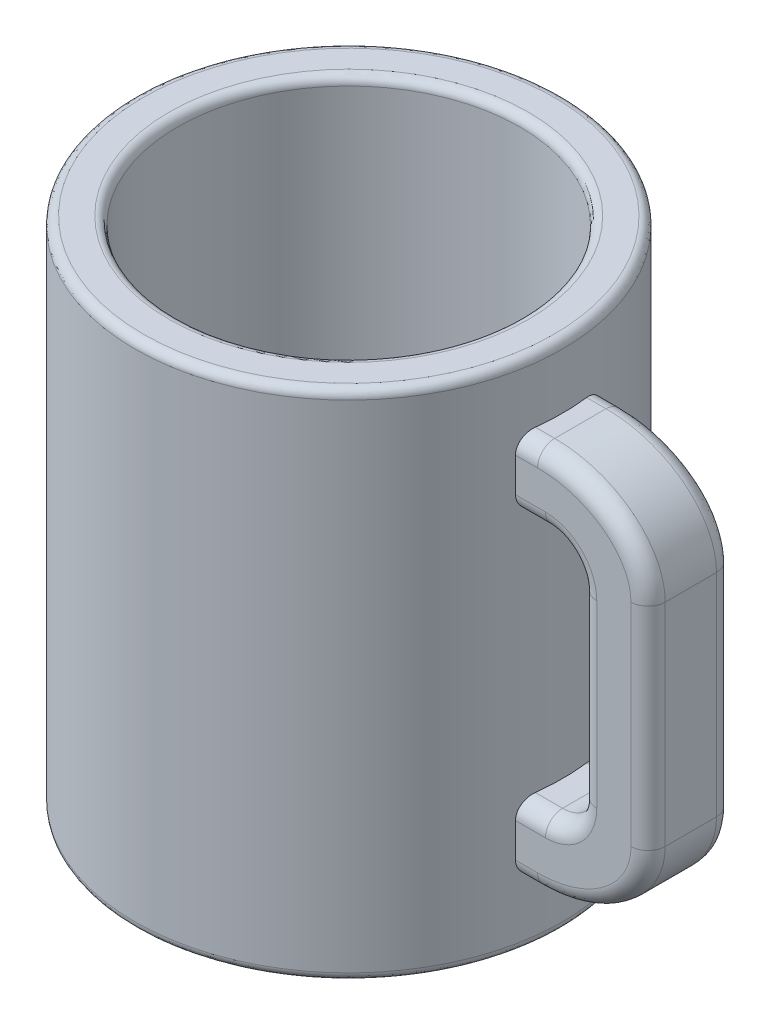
ISO-10303-21;
HEADER;
FILE_DESCRIPTION(('STEP AP214'),'2;1');
FILE_NAME('part.step','',(''),(''),'','','');
FILE_SCHEMA(('AUTOMOTIVE_DESIGN { 1 0 10303 214 1 1 1 1 }'));
ENDSEC;
DATA;
#1=APPLICATION_CONTEXT('core data for automotive mechanical design processes');
#2=APPLICATION_PROTOCOL_DEFINITION('international standard','automotive_design',2000,#1);
#3=PRODUCT_CONTEXT('',#1,'mechanical');
#4=PRODUCT('Part','Part','',(#3));
#5=PRODUCT_RELATED_PRODUCT_CATEGORY('part','',(#4));
#6=PRODUCT_DEFINITION_FORMATION('','',#4);
#7=PRODUCT_DEFINITION_CONTEXT('part definition',#1,'design');
#8=PRODUCT_DEFINITION('design','',#6,#7);
#9=PRODUCT_DEFINITION_SHAPE('','',#8);
#10=(LENGTH_UNIT() NAMED_UNIT(*) SI_UNIT(.MILLI.,.METRE.));
#11=(NAMED_UNIT(*) PLANE_ANGLE_UNIT() SI_UNIT($,.RADIAN.));
#12=(NAMED_UNIT(*) SI_UNIT($,.STERADIAN.) SOLID_ANGLE_UNIT());
#13=UNCERTAINTY_MEASURE_WITH_UNIT(LENGTH_MEASURE(1.E-05),#10,'distance_accuracy_value','');
#14=(GEOMETRIC_REPRESENTATION_CONTEXT(3) GLOBAL_UNCERTAINTY_ASSIGNED_CONTEXT((#13)) GLOBAL_UNIT_ASSIGNED_CONTEXT((#10,
#11,#12)) REPRESENTATION_CONTEXT('',''));
#15=CARTESIAN_POINT('',(0.,0.,0.));
#16=DIRECTION('',(0.,0.,1.));
#17=DIRECTION('',(1.,0.,0.));
#18=AXIS2_PLACEMENT_3D('',#15,#16,#17);
#19=CARTESIAN_POINT('',(-231.7402,-648.0825,0.));
#20=CARTESIAN_POINT('',(-231.7402,-647.5326,0.));
#21=CARTESIAN_POINT('',(-231.2902,-647.0826,0.));
#22=CARTESIAN_POINT('',(-230.7401,-647.0826,0.));
#23=B_SPLINE_CURVE_WITH_KNOTS('',3,(#19,#20,#21,#22),.UNSPECIFIED.,.F.,.F.,(4,4),(0.875,1.),.UNSPECIFIED.);
#24=CARTESIAN_POINT('',(-206.7402,-647.0826,0.));
#25=DIRECTION('',(0.,1.,0.));
#26=AXIS1_PLACEMENT('',#24,#25);
#27=SURFACE_OF_REVOLUTION('',#23,#26);
#28=CARTESIAN_POINT('',(-206.7402,-647.0826,0.));
#29=DIRECTION('',(0.,1.,0.));
#30=DIRECTION('',(0.,0.,1.));
#31=AXIS2_PLACEMENT_3D('',#28,#29,#30);
#32=CIRCLE('',#31,23.9999);
#33=CARTESIAN_POINT('',(-206.7402,-647.0826,23.9999));
#34=VERTEX_POINT('',#33);
#35=EDGE_CURVE('E632',#34,#34,#32,.T.);
#36=ORIENTED_EDGE('',*,*,#35,.F.);
#37=EDGE_LOOP('',(#36));
#38=FACE_BOUND('',#37,.T.);
#39=CARTESIAN_POINT('',(-206.7402,-648.0825,0.));
#40=DIRECTION('',(0.,1.,0.));
#41=DIRECTION('',(0.,0.,1.));
#42=AXIS2_PLACEMENT_3D('',#39,#40,#41);
#43=CIRCLE('',#42,25.);
#44=CARTESIAN_POINT('',(-206.7402,-648.0825,25.));
#45=VERTEX_POINT('',#44);
#46=EDGE_CURVE('E1132',#45,#45,#43,.T.);
#47=ORIENTED_EDGE('',*,*,#46,.T.);
#48=EDGE_LOOP('',(#47));
#49=FACE_BOUND('',#48,.T.);
#50=ADVANCED_FACE('F41',(#38,#49),#27,.T.);
#51=CARTESIAN_POINT('',(-206.7402,-647.0826,0.));
#52=DIRECTION('',(0.,1.,0.));
#53=DIRECTION('',(0.,0.,1.));
#54=AXIS2_PLACEMENT_3D('',#51,#52,#53);
#55=CYLINDRICAL_SURFACE('',#54,25.);
#56=DIRECTION('',(0.,1.,0.));
#57=VECTOR('',#56,1.);
#58=CARTESIAN_POINT('',(-182.245302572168,-647.0826,-5.));
#59=LINE('',#58,#57);
#60=CARTESIAN_POINT('',(-182.245302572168,-697.5826,-5.));
#61=VERTEX_POINT('',#60);
#62=CARTESIAN_POINT('',(-182.245302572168,-693.5826,-5.));
#63=VERTEX_POINT('',#62);
#64=EDGE_CURVE('E817',#61,#63,#59,.T.);
#65=ORIENTED_EDGE('',*,*,#64,.F.);
#66=CARTESIAN_POINT('',(-182.245302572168,-697.5826,-5.));
#67=CARTESIAN_POINT('',(-182.245303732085,-697.638139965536,-5.00000025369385));
#68=CARTESIAN_POINT('',(-182.244829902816,-697.693652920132,-4.99768499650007));
#69=CARTESIAN_POINT('',(-182.242947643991,-697.804273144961,-4.98845265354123));
#70=CARTESIAN_POINT('',(-182.241539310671,-697.859380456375,-4.98153604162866));
#71=CARTESIAN_POINT('',(-182.235944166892,-698.023328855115,-4.9539700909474));
#72=CARTESIAN_POINT('',(-182.230387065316,-698.131058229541,-4.92650431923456));
#73=CARTESIAN_POINT('',(-182.215974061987,-698.340259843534,-4.85424370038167));
#74=CARTESIAN_POINT('',(-182.207117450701,-698.441730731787,-4.80944512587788));
#75=CARTESIAN_POINT('',(-182.186656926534,-698.635695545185,-4.7038710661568));
#76=CARTESIAN_POINT('',(-182.175052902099,-698.728189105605,-4.64309493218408));
#77=CARTESIAN_POINT('',(-182.149643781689,-698.902665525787,-4.50659532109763));
#78=CARTESIAN_POINT('',(-182.135816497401,-698.984525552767,-4.43071910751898));
#79=CARTESIAN_POINT('',(-182.106820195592,-699.134432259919,-4.26656003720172));
#80=CARTESIAN_POINT('',(-182.091650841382,-699.20247545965,-4.17827406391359));
#81=CARTESIAN_POINT('',(-182.060491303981,-699.323972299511,-3.99013944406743));
#82=CARTESIAN_POINT('',(-182.044491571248,-699.377159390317,-3.89012032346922));
#83=CARTESIAN_POINT('',(-182.012687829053,-699.465909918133,-3.68254536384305));
#84=CARTESIAN_POINT('',(-181.996883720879,-699.501482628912,-3.57499352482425));
#85=CARTESIAN_POINT('',(-181.970868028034,-699.545944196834,-3.38911550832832));
#86=CARTESIAN_POINT('',(-181.960427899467,-699.559670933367,-3.31194331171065));
#87=CARTESIAN_POINT('',(-181.940150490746,-699.577999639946,-3.15654097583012));
#88=CARTESIAN_POINT('',(-181.930312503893,-699.582612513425,-3.07831221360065));
#89=CARTESIAN_POINT('',(-181.920852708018,-699.5826,-3.));
#90=B_SPLINE_CURVE_WITH_KNOTS('',3,(#66,#67,#68,#69,#70,#71,#72,#73,#74,#75,#76,#77,#78,#79,#80,
#81,#82,#83,#84,#85,#86,#87,#88,#89),.UNSPECIFIED.,.F.,.F.,(4,2,2,2,2,2,2,2,2,2,2,4),(0.,
0.166516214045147,0.333015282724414,0.66523807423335,0.997532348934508,1.32984011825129,
1.66569769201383,2.00163976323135,2.34327023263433,2.68472064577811,2.92144227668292,
3.15788053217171),.UNSPECIFIED.);
#91=CARTESIAN_POINT('',(-181.920852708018,-699.5826,-3.));
#92=VERTEX_POINT('',#91);
#93=EDGE_CURVE('E251',#61,#92,#90,.T.);
#94=ORIENTED_EDGE('',*,*,#93,.T.);
#95=CARTESIAN_POINT('',(-206.7402,-699.5826,0.));
#96=DIRECTION('',(0.,-1.,0.));
#97=DIRECTION('',(0.,0.,-1.));
#98=AXIS2_PLACEMENT_3D('',#95,#96,#97);
#99=CIRCLE('',#98,25.);
#100=CARTESIAN_POINT('',(-181.920852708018,-699.5826,3.));
#101=VERTEX_POINT('',#100);
#102=EDGE_CURVE('E794',#92,#101,#99,.T.);
#103=ORIENTED_EDGE('',*,*,#102,.T.);
#104=CARTESIAN_POINT('',(-181.920852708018,-699.5826,3.));
#105=CARTESIAN_POINT('',(-181.927720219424,-699.582599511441,3.05682492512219));
#106=CARTESIAN_POINT('',(-181.934781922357,-699.580176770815,3.11359782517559));
#107=CARTESIAN_POINT('',(-181.949239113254,-699.570522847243,3.22668557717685));
#108=CARTESIAN_POINT('',(-181.956634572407,-699.563292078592,3.283000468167));
#109=CARTESIAN_POINT('',(-181.979215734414,-699.534474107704,3.45055051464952));
#110=CARTESIAN_POINT('',(-181.994820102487,-699.505760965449,3.5605879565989));
#111=CARTESIAN_POINT('',(-182.026488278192,-699.430181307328,3.77414150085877));
#112=CARTESIAN_POINT('',(-182.042552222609,-699.383309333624,3.87765563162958));
#113=CARTESIAN_POINT('',(-182.074396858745,-699.272723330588,4.07531321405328));
#114=CARTESIAN_POINT('',(-182.090177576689,-699.209010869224,4.16945753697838));
#115=CARTESIAN_POINT('',(-182.120675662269,-699.066308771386,4.3459263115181));
#116=CARTESIAN_POINT('',(-182.135390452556,-698.98728369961,4.42822256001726));
#117=CARTESIAN_POINT('',(-182.162882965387,-698.816191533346,4.57835419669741));
#118=CARTESIAN_POINT('',(-182.175660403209,-698.724122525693,4.6461874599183));
#119=CARTESIAN_POINT('',(-182.198387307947,-698.530420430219,4.76477237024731));
#120=CARTESIAN_POINT('',(-182.20836124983,-698.428881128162,4.81567261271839));
#121=CARTESIAN_POINT('',(-182.224985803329,-698.218452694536,4.89960387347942));
#122=CARTESIAN_POINT('',(-182.2316391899,-698.109569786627,4.93264981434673));
#123=CARTESIAN_POINT('',(-182.23935219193,-697.930328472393,4.9707818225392));
#124=CARTESIAN_POINT('',(-182.241578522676,-697.861212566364,4.98173053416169));
#125=CARTESIAN_POINT('',(-182.244555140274,-697.722275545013,4.99633872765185));
#126=CARTESIAN_POINT('',(-182.245307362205,-697.652455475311,5.00000776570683));
#127=CARTESIAN_POINT('',(-182.245302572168,-697.5826,5.));
#128=B_SPLINE_CURVE_WITH_KNOTS('',3,(#104,#105,#106,#107,#108,#109,#110,#111,#112,#113,#114,
#115,#116,#117,#118,#119,#120,#121,#122,#123,#124,#125,#126,#127),.UNSPECIFIED.,.F.,.F.,(4,2,2,
2,2,2,2,2,2,2,2,4),(0.,0.171607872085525,0.343200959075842,0.685799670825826,1.02850143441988,
1.37117130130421,1.71464382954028,2.05816678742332,2.39859034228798,2.73872893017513,
2.94840174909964,3.15779914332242),.UNSPECIFIED.);
#129=CARTESIAN_POINT('',(-182.245302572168,-697.5826,5.));
#130=VERTEX_POINT('',#129);
#131=EDGE_CURVE('E11',#101,#130,#128,.T.);
#132=ORIENTED_EDGE('',*,*,#131,.T.);
#133=DIRECTION('',(0.,1.,0.));
#134=VECTOR('',#133,1.);
#135=CARTESIAN_POINT('',(-182.245302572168,-647.0826,5.));
#136=LINE('',#135,#134);
#137=CARTESIAN_POINT('',(-182.245302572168,-693.5826,5.));
#138=VERTEX_POINT('',#137);
#139=EDGE_CURVE('E714',#130,#138,#136,.T.);
#140=ORIENTED_EDGE('',*,*,#139,.T.);
#141=CARTESIAN_POINT('',(-182.245302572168,-693.5826,5.));
#142=CARTESIAN_POINT('',(-182.245303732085,-693.527060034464,5.00000025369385));
#143=CARTESIAN_POINT('',(-182.244829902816,-693.471547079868,4.99768499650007));
#144=CARTESIAN_POINT('',(-182.242947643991,-693.360926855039,4.98845265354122));
#145=CARTESIAN_POINT('',(-182.241539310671,-693.305819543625,4.98153604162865));
#146=CARTESIAN_POINT('',(-182.235944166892,-693.141871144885,4.95397009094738));
#147=CARTESIAN_POINT('',(-182.230387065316,-693.034141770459,4.92650431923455));
#148=CARTESIAN_POINT('',(-182.215974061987,-692.824940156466,4.85424370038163));
#149=CARTESIAN_POINT('',(-182.207117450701,-692.723469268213,4.80944512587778));
#150=CARTESIAN_POINT('',(-182.186656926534,-692.529504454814,4.70387106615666));
#151=CARTESIAN_POINT('',(-182.175052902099,-692.437010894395,4.643094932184));
#152=CARTESIAN_POINT('',(-182.149643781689,-692.262534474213,4.50659532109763));
#153=CARTESIAN_POINT('',(-182.135816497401,-692.180674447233,4.43071910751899));
#154=CARTESIAN_POINT('',(-182.106820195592,-692.030767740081,4.26656003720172));
#155=CARTESIAN_POINT('',(-182.091650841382,-691.962724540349,4.17827406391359));
#156=CARTESIAN_POINT('',(-182.060491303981,-691.841227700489,3.99013944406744));
#157=CARTESIAN_POINT('',(-182.044491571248,-691.788040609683,3.89012032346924));
#158=CARTESIAN_POINT('',(-182.012687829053,-691.699290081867,3.68254536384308));
#159=CARTESIAN_POINT('',(-181.996883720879,-691.663717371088,3.57499352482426));
#160=CARTESIAN_POINT('',(-181.970868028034,-691.619255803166,3.38911550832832));
#161=CARTESIAN_POINT('',(-181.960427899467,-691.605529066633,3.31194331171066));
#162=CARTESIAN_POINT('',(-181.940150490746,-691.587200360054,3.15654097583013));
#163=CARTESIAN_POINT('',(-181.930312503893,-691.582587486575,3.07831221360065));
#164=CARTESIAN_POINT('',(-181.920852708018,-691.5826,3.));
#165=B_SPLINE_CURVE_WITH_KNOTS('',3,(#141,#142,#143,#144,#145,#146,#147,#148,#149,#150,#151,
#152,#153,#154,#155,#156,#157,#158,#159,#160,#161,#162,#163,#164),.UNSPECIFIED.,.F.,.F.,(4,2,2,
2,2,2,2,2,2,2,2,4),(0.,0.166516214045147,0.333015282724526,0.665238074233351,0.997532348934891,
1.32984011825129,1.66569769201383,2.00163976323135,2.34327023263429,2.68472064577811,
2.92144227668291,3.15788053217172),.UNSPECIFIED.);
#166=CARTESIAN_POINT('',(-181.920852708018,-691.5826,3.));
#167=VERTEX_POINT('',#166);
#168=EDGE_CURVE('E247',#138,#167,#165,.T.);
#169=ORIENTED_EDGE('',*,*,#168,.T.);
#170=CARTESIAN_POINT('',(-206.7402,-691.5826,0.));
#171=DIRECTION('',(0.,-1.,0.));
#172=DIRECTION('',(0.,0.,-1.));
#173=AXIS2_PLACEMENT_3D('',#170,#171,#172);
#174=CIRCLE('',#173,25.);
#175=CARTESIAN_POINT('',(-181.920852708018,-691.5826,-3.));
#176=VERTEX_POINT('',#175);
#177=EDGE_CURVE('E720',#176,#167,#174,.T.);
#178=ORIENTED_EDGE('',*,*,#177,.F.);
#179=CARTESIAN_POINT('',(-181.920852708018,-691.5826,-3.));
#180=CARTESIAN_POINT('',(-181.927720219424,-691.582600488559,-3.05682492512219));
#181=CARTESIAN_POINT('',(-181.934781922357,-691.585023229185,-3.11359782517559));
#182=CARTESIAN_POINT('',(-181.949239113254,-691.594677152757,-3.22668557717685));
#183=CARTESIAN_POINT('',(-181.956634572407,-691.601907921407,-3.283000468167));
#184=CARTESIAN_POINT('',(-181.979215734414,-691.630725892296,-3.45055051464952));
#185=CARTESIAN_POINT('',(-181.994820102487,-691.659439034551,-3.5605879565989));
#186=CARTESIAN_POINT('',(-182.026488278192,-691.735018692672,-3.77414150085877));
#187=CARTESIAN_POINT('',(-182.042552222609,-691.781890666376,-3.87765563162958));
#188=CARTESIAN_POINT('',(-182.074396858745,-691.892476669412,-4.07531321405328));
#189=CARTESIAN_POINT('',(-182.090177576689,-691.956189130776,-4.16945753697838));
#190=CARTESIAN_POINT('',(-182.120675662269,-692.098891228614,-4.3459263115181));
#191=CARTESIAN_POINT('',(-182.135390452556,-692.17791630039,-4.42822256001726));
#192=CARTESIAN_POINT('',(-182.162882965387,-692.349008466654,-4.57835419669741));
#193=CARTESIAN_POINT('',(-182.175660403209,-692.441077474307,-4.64618745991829));
#194=CARTESIAN_POINT('',(-182.198387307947,-692.63477956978,-4.76477237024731));
#195=CARTESIAN_POINT('',(-182.20836124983,-692.736318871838,-4.8156726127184));
#196=CARTESIAN_POINT('',(-182.224985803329,-692.946747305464,-4.89960387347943));
#197=CARTESIAN_POINT('',(-182.2316391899,-693.055630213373,-4.93264981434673));
#198=CARTESIAN_POINT('',(-182.23935219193,-693.234871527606,-4.9707818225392));
#199=CARTESIAN_POINT('',(-182.241578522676,-693.303987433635,-4.98173053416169));
#200=CARTESIAN_POINT('',(-182.244555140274,-693.442924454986,-4.99633872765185));
#201=CARTESIAN_POINT('',(-182.245307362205,-693.512744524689,-5.00000776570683));
#202=CARTESIAN_POINT('',(-182.245302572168,-693.5826,-5.));
#203=B_SPLINE_CURVE_WITH_KNOTS('',3,(#179,#180,#181,#182,#183,#184,#185,#186,#187,#188,#189,
#190,#191,#192,#193,#194,#195,#196,#197,#198,#199,#200,#201,#202),.UNSPECIFIED.,.F.,.F.,(4,2,2,
2,2,2,2,2,2,2,2,4),(0.,0.171607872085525,0.343200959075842,0.685799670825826,1.02850143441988,
1.37117130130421,1.71464382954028,2.05816678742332,2.39859034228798,2.73872893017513,
2.94840174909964,3.15779914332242),.UNSPECIFIED.);
#204=EDGE_CURVE('E253',#176,#63,#203,.T.);
#205=ORIENTED_EDGE('',*,*,#204,.T.);
#206=EDGE_LOOP('',(#65,#94,#103,#132,#140,#169,#178,#205));
#207=FACE_BOUND('',#206,.T.);
#208=CARTESIAN_POINT('',(-206.7402,-662.5826,0.));
#209=DIRECTION('',(0.,1.,0.));
#210=DIRECTION('',(0.,0.,1.));
#211=AXIS2_PLACEMENT_3D('',#208,#209,#210);
#212=CIRCLE('',#211,25.);
#213=CARTESIAN_POINT('',(-181.920852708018,-662.5826,3.));
#214=VERTEX_POINT('',#213);
#215=CARTESIAN_POINT('',(-181.920852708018,-662.5826,-3.));
#216=VERTEX_POINT('',#215);
#217=EDGE_CURVE('E217',#214,#216,#212,.T.);
#218=ORIENTED_EDGE('',*,*,#217,.F.);
#219=CARTESIAN_POINT('',(-181.920852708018,-662.5826,3.));
#220=CARTESIAN_POINT('',(-181.927720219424,-662.582599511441,3.05682492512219));
#221=CARTESIAN_POINT('',(-181.934781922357,-662.580176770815,3.11359782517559));
#222=CARTESIAN_POINT('',(-181.949239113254,-662.570522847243,3.22668557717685));
#223=CARTESIAN_POINT('',(-181.956634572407,-662.563292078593,3.283000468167));
#224=CARTESIAN_POINT('',(-181.979215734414,-662.534474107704,3.45055051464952));
#225=CARTESIAN_POINT('',(-181.994820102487,-662.505760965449,3.5605879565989));
#226=CARTESIAN_POINT('',(-182.026488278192,-662.430181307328,3.77414150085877));
#227=CARTESIAN_POINT('',(-182.042552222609,-662.383309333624,3.87765563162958));
#228=CARTESIAN_POINT('',(-182.074396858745,-662.272723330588,4.07531321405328));
#229=CARTESIAN_POINT('',(-182.090177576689,-662.209010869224,4.16945753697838));
#230=CARTESIAN_POINT('',(-182.120675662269,-662.066308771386,4.3459263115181));
#231=CARTESIAN_POINT('',(-182.135390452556,-661.98728369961,4.42822256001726));
#232=CARTESIAN_POINT('',(-182.162882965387,-661.816191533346,4.57835419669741));
#233=CARTESIAN_POINT('',(-182.175660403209,-661.724122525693,4.64618745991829));
#234=CARTESIAN_POINT('',(-182.198387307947,-661.530420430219,4.76477237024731));
#235=CARTESIAN_POINT('',(-182.20836124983,-661.428881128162,4.8156726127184));
#236=CARTESIAN_POINT('',(-182.224985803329,-661.218452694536,4.89960387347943));
#237=CARTESIAN_POINT('',(-182.2316391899,-661.109569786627,4.93264981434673));
#238=CARTESIAN_POINT('',(-182.23935219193,-660.930328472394,4.9707818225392));
#239=CARTESIAN_POINT('',(-182.241578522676,-660.861212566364,4.98173053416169));
#240=CARTESIAN_POINT('',(-182.244555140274,-660.722275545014,4.99633872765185));
#241=CARTESIAN_POINT('',(-182.245307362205,-660.652455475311,5.00000776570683));
#242=CARTESIAN_POINT('',(-182.245302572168,-660.5826,5.));
#243=B_SPLINE_CURVE_WITH_KNOTS('',3,(#219,#220,#221,#222,#223,#224,#225,#226,#227,#228,#229,
#230,#231,#232,#233,#234,#235,#236,#237,#238,#239,#240,#241,#242),.UNSPECIFIED.,.F.,.F.,(4,2,2,
2,2,2,2,2,2,2,2,4),(0.,0.171607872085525,0.343200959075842,0.685799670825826,1.02850143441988,
1.37117130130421,1.71464382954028,2.05816678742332,2.39859034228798,2.73872893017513,
2.94840174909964,3.15779914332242),.UNSPECIFIED.);
#244=CARTESIAN_POINT('',(-182.245302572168,-660.5826,5.));
#245=VERTEX_POINT('',#244);
#246=EDGE_CURVE('E233',#214,#245,#243,.T.);
#247=ORIENTED_EDGE('',*,*,#246,.T.);
#248=CARTESIAN_POINT('',(-182.245302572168,-656.5826,5.));
#249=VERTEX_POINT('',#248);
#250=EDGE_CURVE('E722',#245,#249,#136,.T.);
#251=ORIENTED_EDGE('',*,*,#250,.T.);
#252=CARTESIAN_POINT('',(-182.245302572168,-656.5826,5.));
#253=CARTESIAN_POINT('',(-182.245303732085,-656.527060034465,5.00000025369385));
#254=CARTESIAN_POINT('',(-182.244829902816,-656.471547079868,4.99768499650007));
#255=CARTESIAN_POINT('',(-182.242947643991,-656.360926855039,4.98845265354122));
#256=CARTESIAN_POINT('',(-182.241539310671,-656.305819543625,4.98153604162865));
#257=CARTESIAN_POINT('',(-182.235944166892,-656.141871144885,4.95397009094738));
#258=CARTESIAN_POINT('',(-182.230387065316,-656.034141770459,4.92650431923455));
#259=CARTESIAN_POINT('',(-182.215974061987,-655.824940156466,4.85424370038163));
#260=CARTESIAN_POINT('',(-182.207117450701,-655.723469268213,4.80944512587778));
#261=CARTESIAN_POINT('',(-182.186656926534,-655.529504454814,4.70387106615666));
#262=CARTESIAN_POINT('',(-182.175052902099,-655.437010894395,4.643094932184));
#263=CARTESIAN_POINT('',(-182.149643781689,-655.262534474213,4.50659532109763));
#264=CARTESIAN_POINT('',(-182.135816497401,-655.180674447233,4.43071910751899));
#265=CARTESIAN_POINT('',(-182.106820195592,-655.030767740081,4.26656003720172));
#266=CARTESIAN_POINT('',(-182.091650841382,-654.962724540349,4.17827406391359));
#267=CARTESIAN_POINT('',(-182.060491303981,-654.841227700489,3.99013944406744));
#268=CARTESIAN_POINT('',(-182.044491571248,-654.788040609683,3.89012032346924));
#269=CARTESIAN_POINT('',(-182.012687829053,-654.699290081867,3.68254536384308));
#270=CARTESIAN_POINT('',(-181.996883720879,-654.663717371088,3.57499352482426));
#271=CARTESIAN_POINT('',(-181.970868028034,-654.619255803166,3.38911550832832));
#272=CARTESIAN_POINT('',(-181.960427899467,-654.605529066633,3.31194331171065));
#273=CARTESIAN_POINT('',(-181.940150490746,-654.587200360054,3.15654097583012));
#274=CARTESIAN_POINT('',(-181.930312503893,-654.582587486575,3.07831221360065));
#275=CARTESIAN_POINT('',(-181.920852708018,-654.5826,3.));
#276=B_SPLINE_CURVE_WITH_KNOTS('',3,(#252,#253,#254,#255,#256,#257,#258,#259,#260,#261,#262,
#263,#264,#265,#266,#267,#268,#269,#270,#271,#272,#273,#274,#275),.UNSPECIFIED.,.F.,.F.,(4,2,2,
2,2,2,2,2,2,2,2,4),(0.,0.166516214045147,0.333015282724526,0.665238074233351,0.997532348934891,
1.32984011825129,1.66569769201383,2.00163976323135,2.34327023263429,2.68472064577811,
2.92144227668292,3.15788053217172),.UNSPECIFIED.);
#277=CARTESIAN_POINT('',(-181.920852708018,-654.5826,3.));
#278=VERTEX_POINT('',#277);
#279=EDGE_CURVE('E57',#249,#278,#276,.T.);
#280=ORIENTED_EDGE('',*,*,#279,.T.);
#281=CARTESIAN_POINT('',(-206.7402,-654.5826,0.));
#282=DIRECTION('',(0.,1.,0.));
#283=DIRECTION('',(0.,0.,1.));
#284=AXIS2_PLACEMENT_3D('',#281,#282,#283);
#285=CIRCLE('',#284,25.);
#286=CARTESIAN_POINT('',(-181.920852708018,-654.5826,-3.));
#287=VERTEX_POINT('',#286);
#288=EDGE_CURVE('E239',#278,#287,#285,.T.);
#289=ORIENTED_EDGE('',*,*,#288,.T.);
#290=CARTESIAN_POINT('',(-181.920852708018,-654.5826,-3.));
#291=CARTESIAN_POINT('',(-181.927720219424,-654.582600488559,-3.05682492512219));
#292=CARTESIAN_POINT('',(-181.934781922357,-654.585023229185,-3.11359782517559));
#293=CARTESIAN_POINT('',(-181.949239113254,-654.594677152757,-3.22668557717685));
#294=CARTESIAN_POINT('',(-181.956634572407,-654.601907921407,-3.283000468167));
#295=CARTESIAN_POINT('',(-181.979215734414,-654.630725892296,-3.45055051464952));
#296=CARTESIAN_POINT('',(-181.994820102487,-654.659439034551,-3.5605879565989));
#297=CARTESIAN_POINT('',(-182.026488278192,-654.735018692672,-3.77414150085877));
#298=CARTESIAN_POINT('',(-182.042552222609,-654.781890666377,-3.87765563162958));
#299=CARTESIAN_POINT('',(-182.074396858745,-654.892476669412,-4.07531321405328));
#300=CARTESIAN_POINT('',(-182.090177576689,-654.956189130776,-4.16945753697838));
#301=CARTESIAN_POINT('',(-182.120675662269,-655.098891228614,-4.3459263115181));
#302=CARTESIAN_POINT('',(-182.135390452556,-655.17791630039,-4.42822256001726));
#303=CARTESIAN_POINT('',(-182.162882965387,-655.349008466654,-4.57835419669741));
#304=CARTESIAN_POINT('',(-182.175660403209,-655.441077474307,-4.64618745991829));
#305=CARTESIAN_POINT('',(-182.198387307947,-655.634779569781,-4.76477237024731));
#306=CARTESIAN_POINT('',(-182.20836124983,-655.736318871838,-4.8156726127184));
#307=CARTESIAN_POINT('',(-182.224985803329,-655.946747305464,-4.89960387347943));
#308=CARTESIAN_POINT('',(-182.2316391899,-656.055630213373,-4.93264981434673));
#309=CARTESIAN_POINT('',(-182.23935219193,-656.234871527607,-4.9707818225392));
#310=CARTESIAN_POINT('',(-182.241578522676,-656.303987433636,-4.98173053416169));
#311=CARTESIAN_POINT('',(-182.244555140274,-656.442924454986,-4.99633872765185));
#312=CARTESIAN_POINT('',(-182.245307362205,-656.512744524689,-5.00000776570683));
#313=CARTESIAN_POINT('',(-182.245302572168,-656.5826,-5.));
#314=B_SPLINE_CURVE_WITH_KNOTS('',3,(#290,#291,#292,#293,#294,#295,#296,#297,#298,#299,#300,
#301,#302,#303,#304,#305,#306,#307,#308,#309,#310,#311,#312,#313),.UNSPECIFIED.,.F.,.F.,(4,2,2,
2,2,2,2,2,2,2,2,4),(0.,0.171607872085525,0.343200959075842,0.685799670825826,1.02850143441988,
1.37117130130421,1.71464382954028,2.05816678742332,2.39859034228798,2.73872893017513,
2.94840174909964,3.15779914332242),.UNSPECIFIED.);
#315=CARTESIAN_POINT('',(-182.245302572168,-656.5826,-5.));
#316=VERTEX_POINT('',#315);
#317=EDGE_CURVE('E246',#287,#316,#314,.T.);
#318=ORIENTED_EDGE('',*,*,#317,.T.);
#319=CARTESIAN_POINT('',(-182.245302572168,-660.5826,-5.));
#320=VERTEX_POINT('',#319);
#321=EDGE_CURVE('E240',#320,#316,#59,.T.);
#322=ORIENTED_EDGE('',*,*,#321,.F.);
#323=CARTESIAN_POINT('',(-182.245302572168,-660.5826,-5.));
#324=CARTESIAN_POINT('',(-182.245303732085,-660.638139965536,-5.00000025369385));
#325=CARTESIAN_POINT('',(-182.244829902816,-660.693652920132,-4.99768499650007));
#326=CARTESIAN_POINT('',(-182.242947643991,-660.804273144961,-4.98845265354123));
#327=CARTESIAN_POINT('',(-182.241539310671,-660.859380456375,-4.98153604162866));
#328=CARTESIAN_POINT('',(-182.235944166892,-661.023328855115,-4.9539700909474));
#329=CARTESIAN_POINT('',(-182.230387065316,-661.131058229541,-4.92650431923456));
#330=CARTESIAN_POINT('',(-182.215974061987,-661.340259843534,-4.85424370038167));
#331=CARTESIAN_POINT('',(-182.207117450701,-661.441730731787,-4.80944512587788));
#332=CARTESIAN_POINT('',(-182.186656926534,-661.635695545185,-4.7038710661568));
#333=CARTESIAN_POINT('',(-182.175052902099,-661.728189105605,-4.64309493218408));
#334=CARTESIAN_POINT('',(-182.149643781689,-661.902665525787,-4.50659532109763));
#335=CARTESIAN_POINT('',(-182.135816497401,-661.984525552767,-4.43071910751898));
#336=CARTESIAN_POINT('',(-182.106820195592,-662.134432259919,-4.26656003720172));
#337=CARTESIAN_POINT('',(-182.091650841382,-662.202475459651,-4.17827406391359));
#338=CARTESIAN_POINT('',(-182.060491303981,-662.323972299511,-3.99013944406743));
#339=CARTESIAN_POINT('',(-182.044491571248,-662.377159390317,-3.89012032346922));
#340=CARTESIAN_POINT('',(-182.012687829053,-662.465909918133,-3.68254536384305));
#341=CARTESIAN_POINT('',(-181.996883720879,-662.501482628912,-3.57499352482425));
#342=CARTESIAN_POINT('',(-181.970868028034,-662.545944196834,-3.38911550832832));
#343=CARTESIAN_POINT('',(-181.960427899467,-662.559670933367,-3.31194331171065));
#344=CARTESIAN_POINT('',(-181.940150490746,-662.577999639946,-3.15654097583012));
#345=CARTESIAN_POINT('',(-181.930312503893,-662.582612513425,-3.07831221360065));
#346=CARTESIAN_POINT('',(-181.920852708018,-662.5826,-3.));
#347=B_SPLINE_CURVE_WITH_KNOTS('',3,(#323,#324,#325,#326,#327,#328,#329,#330,#331,#332,#333,
#334,#335,#336,#337,#338,#339,#340,#341,#342,#343,#344,#345,#346),.UNSPECIFIED.,.F.,.F.,(4,2,2,
2,2,2,2,2,2,2,2,4),(0.,0.166516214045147,0.333015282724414,0.66523807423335,0.997532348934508,
1.32984011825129,1.66569769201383,2.00163976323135,2.34327023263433,2.68472064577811,
2.92144227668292,3.15788053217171),.UNSPECIFIED.);
#348=EDGE_CURVE('E237',#320,#216,#347,.T.);
#349=ORIENTED_EDGE('',*,*,#348,.T.);
#350=EDGE_LOOP('',(#218,#247,#251,#280,#289,#318,#322,#349));
#351=FACE_BOUND('',#350,.T.);
#352=ORIENTED_EDGE('',*,*,#46,.F.);
#353=EDGE_LOOP('',(#352));
#354=FACE_BOUND('',#353,.T.);
#355=CARTESIAN_POINT('',(-206.7402,-706.0825,0.));
#356=DIRECTION('',(0.,1.,0.));
#357=DIRECTION('',(0.,0.,1.));
#358=AXIS2_PLACEMENT_3D('',#355,#356,#357);
#359=CIRCLE('',#358,25.);
#360=CARTESIAN_POINT('',(-206.7402,-706.0825,25.));
#361=VERTEX_POINT('',#360);
#362=EDGE_CURVE('E656',#361,#361,#359,.T.);
#363=ORIENTED_EDGE('',*,*,#362,.T.);
#364=EDGE_LOOP('',(#363));
#365=FACE_BOUND('',#364,.T.);
#366=ADVANCED_FACE('F230',(#207,#351,#354,#365),#55,.T.);
#367=CARTESIAN_POINT('',(-230.7401,-707.0826,0.));
#368=CARTESIAN_POINT('',(-231.2902,-707.0826,0.));
#369=CARTESIAN_POINT('',(-231.7402,-706.6326,0.));
#370=CARTESIAN_POINT('',(-231.7402,-706.0825,0.));
#371=B_SPLINE_CURVE_WITH_KNOTS('',3,(#367,#368,#369,#370),.UNSPECIFIED.,.F.,.F.,(4,4),(0.625,
0.75),.UNSPECIFIED.);
#372=CARTESIAN_POINT('',(-206.7402,-647.0826,0.));
#373=DIRECTION('',(0.,1.,0.));
#374=AXIS1_PLACEMENT('',#372,#373);
#375=SURFACE_OF_REVOLUTION('',#371,#374);
#376=ORIENTED_EDGE('',*,*,#362,.F.);
#377=EDGE_LOOP('',(#376));
#378=FACE_BOUND('',#377,.T.);
#379=CARTESIAN_POINT('',(-206.7402,-707.0826,0.));
#380=DIRECTION('',(0.,1.,0.));
#381=DIRECTION('',(0.,0.,1.));
#382=AXIS2_PLACEMENT_3D('',#379,#380,#381);
#383=CIRCLE('',#382,23.9999);
#384=CARTESIAN_POINT('',(-206.7402,-707.0826,23.9999));
#385=VERTEX_POINT('',#384);
#386=EDGE_CURVE('E652',#385,#385,#383,.T.);
#387=ORIENTED_EDGE('',*,*,#386,.T.);
#388=EDGE_LOOP('',(#387));
#389=FACE_BOUND('',#388,.T.);
#390=ADVANCED_FACE('F612',(#378,#389),#375,.T.);
#391=CARTESIAN_POINT('',(0.,-707.0826,0.));
#392=DIRECTION('',(0.,1.,0.));
#393=DIRECTION('',(0.,0.,1.));
#394=AXIS2_PLACEMENT_3D('',#391,#392,#393);
#395=PLANE('',#394);
#396=ORIENTED_EDGE('',*,*,#386,.F.);
#397=EDGE_LOOP('',(#396));
#398=FACE_BOUND('',#397,.T.);
#399=ADVANCED_FACE('F639',(#398),#395,.F.);
#400=CARTESIAN_POINT('',(0.,-647.0826,0.));
#401=DIRECTION('',(0.,-1.,0.));
#402=DIRECTION('',(0.,0.,-1.));
#403=AXIS2_PLACEMENT_3D('',#400,#401,#402);
#404=PLANE('',#403);
#405=CARTESIAN_POINT('',(-206.7402,-647.0826,0.));
#406=DIRECTION('',(0.,-1.,0.));
#407=DIRECTION('',(0.,0.,-1.));
#408=AXIS2_PLACEMENT_3D('',#405,#406,#407);
#409=CIRCLE('',#408,21.);
#410=CARTESIAN_POINT('',(-206.7402,-647.0826,-21.));
#411=VERTEX_POINT('',#410);
#412=EDGE_CURVE('E227',#411,#411,#409,.T.);
#413=ORIENTED_EDGE('',*,*,#412,.T.);
#414=EDGE_LOOP('',(#413));
#415=FACE_BOUND('',#414,.T.);
#416=ORIENTED_EDGE('',*,*,#35,.T.);
#417=EDGE_LOOP('',(#416));
#418=FACE_BOUND('',#417,.T.);
#419=ADVANCED_FACE('F452',(#415,#418),#404,.F.);
#420=CARTESIAN_POINT('',(0.,0.,5.));
#421=DIRECTION('',(0.,0.,1.));
#422=DIRECTION('',(1.,0.,0.));
#423=AXIS2_PLACEMENT_3D('',#420,#421,#422);
#424=PLANE('',#423);
#425=CARTESIAN_POINT('',(-178.7402,-687.5826,5.));
#426=DIRECTION('',(0.,0.,1.));
#427=DIRECTION('',(1.,0.,0.));
#428=AXIS2_PLACEMENT_3D('',#425,#426,#427);
#429=CIRCLE('',#428,6.);
#430=CARTESIAN_POINT('',(-172.7402,-687.5826,5.));
#431=VERTEX_POINT('',#430);
#432=CARTESIAN_POINT('',(-178.7402,-693.5826,5.));
#433=VERTEX_POINT('',#432);
#434=EDGE_CURVE('E501',#431,#433,#429,.F.);
#435=ORIENTED_EDGE('',*,*,#434,.T.);
#436=DIRECTION('',(-1.,0.,0.));
#437=VECTOR('',#436,1.);
#438=CARTESIAN_POINT('',(-182.245302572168,-693.5826,5.));
#439=LINE('',#438,#437);
#440=EDGE_CURVE('E504',#433,#138,#439,.T.);
#441=ORIENTED_EDGE('',*,*,#440,.T.);
#442=ORIENTED_EDGE('',*,*,#139,.F.);
#443=DIRECTION('',(-1.,0.,0.));
#444=VECTOR('',#443,1.);
#445=CARTESIAN_POINT('',(0.,-697.5826,5.));
#446=LINE('',#445,#444);
#447=CARTESIAN_POINT('',(-179.6575,-697.5826,5.));
#448=VERTEX_POINT('',#447);
#449=EDGE_CURVE('E487',#130,#448,#446,.F.);
#450=ORIENTED_EDGE('',*,*,#449,.T.);
#451=CARTESIAN_POINT('',(-168.7402,-684.3972846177,5.));
#452=CARTESIAN_POINT('',(-166.7402,-684.3972846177,5.));
#453=CARTESIAN_POINT('',(-166.7402,-684.3972846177,3.));
#454=CARTESIAN_POINT('',(-168.7402,-686.083123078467,5.));
#455=CARTESIAN_POINT('',(-166.7402,-686.083123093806,5.));
#456=CARTESIAN_POINT('',(-166.7402,-686.083123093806,3.));
#457=CARTESIAN_POINT('',(-168.7402,-687.768961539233,5.));
#458=CARTESIAN_POINT('',(-166.7402,-687.768961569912,5.));
#459=CARTESIAN_POINT('',(-166.7402,-687.768961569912,3.));
#460=CARTESIAN_POINT('',(-168.7402,-689.4548,5.));
#461=CARTESIAN_POINT('',(-166.7402,-689.454800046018,5.));
#462=CARTESIAN_POINT('',(-166.7402,-689.454800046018,3.));
#463=CARTESIAN_POINT('',(-168.740196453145,-689.552902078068,5.));
#464=CARTESIAN_POINT('',(-166.74019150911,-689.585564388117,5.));
#465=CARTESIAN_POINT('',(-166.74019150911,-689.585564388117,3.));
#466=CARTESIAN_POINT('',(-168.742604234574,-689.65098923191,5.));
#467=CARTESIAN_POINT('',(-166.743405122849,-689.716470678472,5.));
#468=CARTESIAN_POINT('',(-166.743405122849,-689.716470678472,3.));
#469=CARTESIAN_POINT('',(-168.75224958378,-689.846923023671,5.));
#470=CARTESIAN_POINT('',(-166.75628578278,-689.978096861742,5.));
#471=CARTESIAN_POINT('',(-166.75628578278,-689.978096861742,3.));
#472=CARTESIAN_POINT('',(-168.759487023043,-689.944769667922,5.));
#473=CARTESIAN_POINT('',(-166.765952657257,-690.108816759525,5.));
#474=CARTESIAN_POINT('',(-166.765952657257,-690.108816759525,3.));
#475=CARTESIAN_POINT('',(-168.788432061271,-690.23741166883,5.));
#476=CARTESIAN_POINT('',(-166.804617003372,-690.499696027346,5.));
#477=CARTESIAN_POINT('',(-166.804617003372,-690.499696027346,3.));
#478=CARTESIAN_POINT('',(-168.817372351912,-690.431540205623,5.));
#479=CARTESIAN_POINT('',(-166.843278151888,-690.758883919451,5.));
#480=CARTESIAN_POINT('',(-166.843278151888,-690.758883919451,3.));
#481=CARTESIAN_POINT('',(-168.893615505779,-690.81403977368,5.));
#482=CARTESIAN_POINT('',(-166.94476314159,-691.268034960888,5.));
#483=CARTESIAN_POINT('',(-166.944763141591,-691.268034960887,3.));
#484=CARTESIAN_POINT('',(-168.940727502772,-691.002449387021,5.));
#485=CARTESIAN_POINT('',(-167.007335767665,-691.518065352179,5.));
#486=CARTESIAN_POINT('',(-167.007335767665,-691.518065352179,3.));
#487=CARTESIAN_POINT('',(-169.052313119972,-691.374067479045,5.));
#488=CARTESIAN_POINT('',(-167.154688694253,-692.008805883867,5.));
#489=CARTESIAN_POINT('',(-167.154688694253,-692.008805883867,3.));
#490=CARTESIAN_POINT('',(-169.116789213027,-691.557275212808,5.));
#491=CARTESIAN_POINT('',(-167.239472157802,-692.249514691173,5.));
#492=CARTESIAN_POINT('',(-167.239472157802,-692.249514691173,3.));
#493=CARTESIAN_POINT('',(-169.261532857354,-691.916606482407,5.));
#494=CARTESIAN_POINT('',(-167.428481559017,-692.718745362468,5.));
#495=CARTESIAN_POINT('',(-167.428481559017,-692.718745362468,3.));
#496=CARTESIAN_POINT('',(-169.341746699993,-692.092751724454,5.));
#497=CARTESIAN_POINT('',(-167.53264130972,-692.947305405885,5.));
#498=CARTESIAN_POINT('',(-167.53264130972,-692.947305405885,3.));
#499=CARTESIAN_POINT('',(-169.516601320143,-692.437650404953,5.));
#500=CARTESIAN_POINT('',(-167.758034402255,-693.391884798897,5.));
#501=CARTESIAN_POINT('',(-167.758034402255,-693.391884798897,3.));
#502=CARTESIAN_POINT('',(-169.611241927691,-692.606403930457,5.));
#503=CARTESIAN_POINT('',(-167.879267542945,-693.607904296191,5.));
#504=CARTESIAN_POINT('',(-167.879267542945,-693.607904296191,3.));
#505=CARTESIAN_POINT('',(-169.915168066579,-693.101512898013,5.));
#506=CARTESIAN_POINT('',(-168.265703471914,-694.237461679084,5.));
#507=CARTESIAN_POINT('',(-168.265703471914,-694.237461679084,3.));
#508=CARTESIAN_POINT('',(-170.144158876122,-693.415996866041,5.));
#509=CARTESIAN_POINT('',(-168.55324818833,-694.631560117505,5.));
#510=CARTESIAN_POINT('',(-168.55324818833,-694.631560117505,3.));
#511=CARTESIAN_POINT('',(-170.564300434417,-693.916159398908,5.));
#512=CARTESIAN_POINT('',(-169.073768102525,-695.251197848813,5.));
#513=CARTESIAN_POINT('',(-169.073768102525,-695.251197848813,3.));
#514=CARTESIAN_POINT('',(-170.744651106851,-694.111208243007,5.));
#515=CARTESIAN_POINT('',(-169.295403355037,-695.490730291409,5.));
#516=CARTESIAN_POINT('',(-169.295403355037,-695.490730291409,3.));
#517=CARTESIAN_POINT('',(-171.121753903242,-694.484921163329,5.));
#518=CARTESIAN_POINT('',(-169.755332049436,-695.946526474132,5.));
#519=CARTESIAN_POINT('',(-169.755332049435,-695.946526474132,3.));
#520=CARTESIAN_POINT('',(-171.318511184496,-694.663580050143,5.));
#521=CARTESIAN_POINT('',(-169.993630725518,-696.162782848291,5.));
#522=CARTESIAN_POINT('',(-169.993630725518,-696.162782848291,3.));
#523=CARTESIAN_POINT('',(-171.725995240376,-695.004546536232,5.));
#524=CARTESIAN_POINT('',(-170.484005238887,-696.573107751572,5.));
#525=CARTESIAN_POINT('',(-170.484005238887,-696.573107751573,3.));
#526=CARTESIAN_POINT('',(-171.936736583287,-695.166836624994,5.));
#527=CARTESIAN_POINT('',(-170.736095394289,-696.767152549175,5.));
#528=CARTESIAN_POINT('',(-170.736095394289,-696.767152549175,3.));
#529=CARTESIAN_POINT('',(-172.369842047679,-695.475010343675,5.));
#530=CARTESIAN_POINT('',(-171.251449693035,-697.133848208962,5.));
#531=CARTESIAN_POINT('',(-171.251449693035,-697.133848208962,3.));
#532=CARTESIAN_POINT('',(-172.592206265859,-695.620893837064,5.));
#533=CARTESIAN_POINT('',(-171.51471392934,-697.306498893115,5.));
#534=CARTESIAN_POINT('',(-171.51471392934,-697.306498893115,3.));
#535=CARTESIAN_POINT('',(-173.114205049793,-695.937359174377,5.));
#536=CARTESIAN_POINT('',(-172.130047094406,-697.679552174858,5.));
#537=CARTESIAN_POINT('',(-172.130047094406,-697.679552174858,3.));
#538=CARTESIAN_POINT('',(-173.417194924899,-696.102431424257,5.));
#539=CARTESIAN_POINT('',(-172.485294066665,-697.872995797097,5.));
#540=CARTESIAN_POINT('',(-172.485294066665,-697.872995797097,3.));
#541=CARTESIAN_POINT('',(-174.036232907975,-696.405798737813,5.));
#542=CARTESIAN_POINT('',(-173.20794725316,-698.227134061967,5.));
#543=CARTESIAN_POINT('',(-173.20794725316,-698.227134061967,3.));
#544=CARTESIAN_POINT('',(-174.352285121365,-696.544085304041,5.));
#545=CARTESIAN_POINT('',(-173.575357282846,-698.387818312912,5.));
#546=CARTESIAN_POINT('',(-173.575357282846,-698.387818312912,3.));
#547=CARTESIAN_POINT('',(-175.316157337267,-696.919535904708,5.));
#548=CARTESIAN_POINT('',(-174.692146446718,-698.822856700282,5.));
#549=CARTESIAN_POINT('',(-174.692146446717,-698.822856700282,3.));
#550=CARTESIAN_POINT('',(-175.979781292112,-697.117343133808,5.));
#551=CARTESIAN_POINT('',(-175.45618848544,-699.050257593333,5.));
#552=CARTESIAN_POINT('',(-175.45618848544,-699.050257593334,3.));
#553=CARTESIAN_POINT('',(-177.148060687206,-697.371208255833,5.));
#554=CARTESIAN_POINT('',(-176.795975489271,-699.341362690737,5.));
#555=CARTESIAN_POINT('',(-176.795975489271,-699.341362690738,3.));
#556=CARTESIAN_POINT('',(-177.647875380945,-697.451007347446,5.));
#557=CARTESIAN_POINT('',(-177.36755468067,-699.432557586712,5.));
#558=CARTESIAN_POINT('',(-177.36755468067,-699.432557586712,3.));
#559=CARTESIAN_POINT('',(-178.650949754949,-697.556570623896,5.));
#560=CARTESIAN_POINT('',(-178.512192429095,-699.553006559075,5.));
#561=CARTESIAN_POINT('',(-178.512192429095,-699.553006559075,3.));
#562=CARTESIAN_POINT('',(-179.154183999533,-697.582575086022,5.));
#563=CARTESIAN_POINT('',(-179.085232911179,-699.582536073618,5.));
#564=CARTESIAN_POINT('',(-179.085232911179,-699.582536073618,3.));
#565=CARTESIAN_POINT('',(-179.6575,-697.5826,5.));
#566=CARTESIAN_POINT('',(-179.657499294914,-699.5826,5.));
#567=CARTESIAN_POINT('',(-179.657499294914,-699.5826,3.));
#568=CARTESIAN_POINT('',(-183.029176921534,-697.5826,5.));
#569=CARTESIAN_POINT('',(-183.029176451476,-699.5826,5.));
#570=CARTESIAN_POINT('',(-183.029176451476,-699.5826,3.));
#571=CARTESIAN_POINT('',(-186.400853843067,-697.5826,5.));
#572=CARTESIAN_POINT('',(-186.400853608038,-699.5826,5.));
#573=CARTESIAN_POINT('',(-186.400853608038,-699.5826,3.));
#574=CARTESIAN_POINT('',(-189.772530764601,-697.5826,5.));
#575=CARTESIAN_POINT('',(-189.772530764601,-699.5826,5.));
#576=CARTESIAN_POINT('',(-189.772530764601,-699.5826,3.));
#577=(BOUNDED_SURFACE() B_SPLINE_SURFACE(3,2,((#451,#452,#453),(#454,#455,#456),(#457,#458,
#459),(#460,#461,#462),(#463,#464,#465),(#466,#467,#468),(#469,#470,#471),(#472,#473,#474),
(#475,#476,#477),(#478,#479,#480),(#481,#482,#483),(#484,#485,#486),(#487,#488,#489),(#490,#491,
#492),(#493,#494,#495),(#496,#497,#498),(#499,#500,#501),(#502,#503,#504),(#505,#506,#507),
(#508,#509,#510),(#511,#512,#513),(#514,#515,#516),(#517,#518,#519),(#520,#521,#522),(#523,#524,
#525),(#526,#527,#528),(#529,#530,#531),(#532,#533,#534),(#535,#536,#537),(#538,#539,#540),
(#541,#542,#543),(#544,#545,#546),(#547,#548,#549),(#550,#551,#552),(#553,#554,#555),(#556,#557,
#558),(#559,#560,#561),(#562,#563,#564),(#565,#566,#567),(#568,#569,#570),(#571,#572,#573),
(#574,#575,#576)),.UNSPECIFIED.,.F.,.F.,.F.) B_SPLINE_SURFACE_WITH_KNOTS((4,3,2,2,2,2,2,2,2,2,2,
2,2,2,2,2,2,2,3,4),(3,3),(0.,5.05751538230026,5.35176157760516,5.64599994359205,
6.23378640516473,6.81556017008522,7.39741683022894,7.97732127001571,8.55721887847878,
9.71932582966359,10.5153900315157,11.3117054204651,12.1088638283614,12.9060288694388,
13.9396527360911,14.9736039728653,17.0412021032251,18.5570029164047,20.0660185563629,
30.1810493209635),(0.,1.),
.UNSPECIFIED.) GEOMETRIC_REPRESENTATION_ITEM() RATIONAL_B_SPLINE_SURFACE(((1.,0.707106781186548,
1.),(1.,0.707106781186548,1.),(1.,0.707106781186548,1.),(1.,0.707106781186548,1.),(1.,
0.707106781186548,1.),(1.,0.707106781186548,1.),(1.,0.707106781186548,1.),(1.,0.707106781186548,
1.),(1.,0.707106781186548,1.),(1.,0.707106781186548,1.),(1.,0.707106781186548,1.),(1.,
0.707106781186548,1.),(1.,0.707106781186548,1.),(1.,0.707106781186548,1.),(1.,0.707106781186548,
1.),(1.,0.707106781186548,1.),(1.,0.707106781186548,1.),(1.,0.707106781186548,1.),(1.,
0.707106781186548,1.),(1.,0.707106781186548,1.),(1.,0.707106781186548,1.),(1.,0.707106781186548,
1.),(1.,0.707106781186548,1.),(1.,0.707106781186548,1.),(1.,0.707106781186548,1.),(1.,
0.707106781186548,1.),(1.,0.707106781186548,1.),(1.,0.707106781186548,1.),(1.,0.707106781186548,
1.),(1.,0.707106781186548,1.),(1.,0.707106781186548,1.),(1.,0.707106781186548,1.),(1.,
0.707106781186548,1.),(1.,0.707106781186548,1.),(1.,0.707106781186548,1.),(1.,0.707106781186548,
1.),(1.,0.707106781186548,1.),(1.,0.707106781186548,1.),(1.,0.707106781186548,1.),(1.,
0.707106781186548,1.),(1.,0.707106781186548,1.),(1.,0.707106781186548,1.))) REPRESENTATION_ITEM('') SURFACE());
#578=CARTESIAN_POINT('',(-189.772530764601,-697.5826,5.));
#579=CARTESIAN_POINT('',(-186.400853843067,-697.5826,5.));
#580=CARTESIAN_POINT('',(-183.029176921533,-697.5826,5.));
#581=CARTESIAN_POINT('',(-179.6575,-697.5826,5.));
#582=CARTESIAN_POINT('',(-179.154183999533,-697.582575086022,5.));
#583=CARTESIAN_POINT('',(-178.650949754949,-697.556570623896,5.));
#584=CARTESIAN_POINT('',(-177.647875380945,-697.451007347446,5.));
#585=CARTESIAN_POINT('',(-177.148060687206,-697.371208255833,5.));
#586=CARTESIAN_POINT('',(-175.979781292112,-697.117343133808,5.));
#587=CARTESIAN_POINT('',(-175.316157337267,-696.919535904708,5.));
#588=CARTESIAN_POINT('',(-174.352285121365,-696.544085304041,5.));
#589=CARTESIAN_POINT('',(-174.036232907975,-696.405798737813,5.));
#590=CARTESIAN_POINT('',(-173.417194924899,-696.102431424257,5.));
#591=CARTESIAN_POINT('',(-173.114205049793,-695.937359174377,5.));
#592=CARTESIAN_POINT('',(-172.592206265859,-695.620893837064,5.));
#593=CARTESIAN_POINT('',(-172.369842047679,-695.475010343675,5.));
#594=CARTESIAN_POINT('',(-171.936736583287,-695.166836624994,5.));
#595=CARTESIAN_POINT('',(-171.725995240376,-695.004546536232,5.));
#596=CARTESIAN_POINT('',(-171.318511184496,-694.663580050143,5.));
#597=CARTESIAN_POINT('',(-171.121753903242,-694.484921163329,5.));
#598=CARTESIAN_POINT('',(-170.744651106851,-694.111208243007,5.));
#599=CARTESIAN_POINT('',(-170.564300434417,-693.916159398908,5.));
#600=CARTESIAN_POINT('',(-170.144158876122,-693.415996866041,5.));
#601=CARTESIAN_POINT('',(-169.915168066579,-693.101512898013,5.));
#602=CARTESIAN_POINT('',(-169.611241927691,-692.606403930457,5.));
#603=CARTESIAN_POINT('',(-169.516601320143,-692.437650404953,5.));
#604=CARTESIAN_POINT('',(-169.341746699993,-692.092751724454,5.));
#605=CARTESIAN_POINT('',(-169.261532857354,-691.916606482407,5.));
#606=CARTESIAN_POINT('',(-169.116789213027,-691.557275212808,5.));
#607=CARTESIAN_POINT('',(-169.052313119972,-691.374067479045,5.));
#608=CARTESIAN_POINT('',(-168.940727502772,-691.002449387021,5.));
#609=CARTESIAN_POINT('',(-168.893615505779,-690.814039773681,5.));
#610=CARTESIAN_POINT('',(-168.817372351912,-690.431540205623,5.));
#611=CARTESIAN_POINT('',(-168.788432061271,-690.23741166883,5.));
#612=CARTESIAN_POINT('',(-168.759487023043,-689.944769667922,5.));
#613=CARTESIAN_POINT('',(-168.75224958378,-689.846923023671,5.));
#614=CARTESIAN_POINT('',(-168.742604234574,-689.65098923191,5.));
#615=CARTESIAN_POINT('',(-168.740196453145,-689.552902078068,5.));
#616=CARTESIAN_POINT('',(-168.7402,-689.4548,5.));
#617=CARTESIAN_POINT('',(-168.7402,-687.768961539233,5.));
#618=CARTESIAN_POINT('',(-168.7402,-686.083123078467,5.));
#619=CARTESIAN_POINT('',(-168.7402,-684.3972846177,5.));
#620=B_SPLINE_CURVE_WITH_KNOTS('',3,(#578,#579,#580,#581,#582,#583,#584,#585,#586,#587,#588,
#589,#590,#591,#592,#593,#594,#595,#596,#597,#598,#599,#600,#601,#602,#603,#604,#605,#606,#607,
#608,#609,#610,#611,#612,#613,#614,#615,#616,#617,#618,#619),.UNSPECIFIED.,.F.,.F.,(4,3,2,2,2,2,
2,2,2,2,2,2,2,2,2,2,2,2,3,4),(0.,10.1150307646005,11.6240464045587,13.1398472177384,
15.2074453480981,16.2413965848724,17.2750204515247,18.0721854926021,18.8693439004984,
19.6656592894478,20.4617234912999,21.6238304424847,22.2037280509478,22.7836324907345,
23.3654891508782,23.9472629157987,24.5350493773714,24.8292877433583,25.1235339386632,
30.1810493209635),.UNSPECIFIED.);
#621=CARTESIAN_POINT('',(-168.7402,-689.4548,5.));
#622=VERTEX_POINT('',#621);
#623=EDGE_CURVE('E480',#448,#622,#620,.T.);
#624=ORIENTED_EDGE('',*,*,#623,.T.);
#625=DIRECTION('',(0.,-1.,0.));
#626=VECTOR('',#625,1.);
#627=CARTESIAN_POINT('',(-168.7402,0.,5.));
#628=LINE('',#627,#626);
#629=CARTESIAN_POINT('',(-168.7402,-664.7104,5.));
#630=VERTEX_POINT('',#629);
#631=EDGE_CURVE('E471',#622,#630,#628,.F.);
#632=ORIENTED_EDGE('',*,*,#631,.T.);
#633=CARTESIAN_POINT('',(-189.772530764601,-656.5826,5.));
#634=CARTESIAN_POINT('',(-189.772530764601,-654.5826,5.));
#635=CARTESIAN_POINT('',(-189.772530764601,-654.5826,3.));
#636=CARTESIAN_POINT('',(-186.400853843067,-656.5826,5.));
#637=CARTESIAN_POINT('',(-186.400853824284,-654.5826,5.));
#638=CARTESIAN_POINT('',(-186.400853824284,-654.5826,3.));
#639=CARTESIAN_POINT('',(-183.029176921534,-656.5826,5.));
#640=CARTESIAN_POINT('',(-183.029176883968,-654.5826,5.));
#641=CARTESIAN_POINT('',(-183.029176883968,-654.5826,3.));
#642=CARTESIAN_POINT('',(-179.6575,-656.5826,5.));
#643=CARTESIAN_POINT('',(-179.657499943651,-654.5826,5.));
#644=CARTESIAN_POINT('',(-179.657499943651,-654.5826,3.));
#645=CARTESIAN_POINT('',(-179.228230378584,-656.582584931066,5.));
#646=CARTESIAN_POINT('',(-179.169442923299,-654.582604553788,5.));
#647=CARTESIAN_POINT('',(-179.169442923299,-654.582604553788,3.));
#648=CARTESIAN_POINT('',(-178.798875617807,-656.601524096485,5.));
#649=CARTESIAN_POINT('',(-178.680634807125,-654.604117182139,5.));
#650=CARTESIAN_POINT('',(-178.680634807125,-654.604117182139,3.));
#651=CARTESIAN_POINT('',(-177.943046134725,-656.678129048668,5.));
#652=CARTESIAN_POINT('',(-177.70460424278,-654.691470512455,5.));
#653=CARTESIAN_POINT('',(-177.70460424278,-654.691470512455,3.));
#654=CARTESIAN_POINT('',(-177.516576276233,-656.735848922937,5.));
#655=CARTESIAN_POINT('',(-177.217384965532,-654.757373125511,5.));
#656=CARTESIAN_POINT('',(-177.217384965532,-654.757373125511,3.));
#657=CARTESIAN_POINT('',(-176.667722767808,-656.891399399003,5.));
#658=CARTESIAN_POINT('',(-176.245496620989,-654.935468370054,5.));
#659=CARTESIAN_POINT('',(-176.245496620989,-654.935468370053,3.));
#660=CARTESIAN_POINT('',(-176.245391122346,-656.989517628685,5.));
#661=CARTESIAN_POINT('',(-175.76087161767,-655.047992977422,5.));
#662=CARTESIAN_POINT('',(-175.76087161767,-655.047992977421,3.));
#663=CARTESIAN_POINT('',(-175.412721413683,-657.226444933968,5.));
#664=CARTESIAN_POINT('',(-174.802525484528,-655.320685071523,5.));
#665=CARTESIAN_POINT('',(-174.802525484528,-655.320685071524,3.));
#666=CARTESIAN_POINT('',(-175.002374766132,-657.365224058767,5.));
#667=CARTESIAN_POINT('',(-174.328796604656,-655.480817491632,5.));
#668=CARTESIAN_POINT('',(-174.328796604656,-655.480817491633,3.));
#669=CARTESIAN_POINT('',(-174.038765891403,-657.747597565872,5.));
#670=CARTESIAN_POINT('',(-173.211748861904,-655.924039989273,5.));
#671=CARTESIAN_POINT('',(-173.211748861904,-655.924039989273,3.));
#672=CARTESIAN_POINT('',(-173.493024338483,-658.010942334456,5.));
#673=CARTESIAN_POINT('',(-172.575296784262,-656.230714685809,5.));
#674=CARTESIAN_POINT('',(-172.575296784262,-656.230714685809,3.));
#675=CARTESIAN_POINT('',(-172.711972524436,-658.467785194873,5.));
#676=CARTESIAN_POINT('',(-171.656292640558,-656.768274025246,5.));
#677=CARTESIAN_POINT('',(-171.656292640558,-656.768274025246,3.));
#678=CARTESIAN_POINT('',(-172.45811989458,-658.630175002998,5.));
#679=CARTESIAN_POINT('',(-171.356189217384,-656.960151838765,5.));
#680=CARTESIAN_POINT('',(-171.356189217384,-656.960151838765,3.));
#681=CARTESIAN_POINT('',(-171.965191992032,-658.975911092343,5.));
#682=CARTESIAN_POINT('',(-170.770193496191,-657.371164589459,5.));
#683=CARTESIAN_POINT('',(-170.770193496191,-657.371164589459,3.));
#684=CARTESIAN_POINT('',(-171.726112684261,-659.159251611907,5.));
#685=CARTESIAN_POINT('',(-170.484297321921,-657.590292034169,5.));
#686=CARTESIAN_POINT('',(-170.484297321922,-657.590292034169,3.));
#687=CARTESIAN_POINT('',(-171.149348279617,-659.645325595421,5.));
#688=CARTESIAN_POINT('',(-169.789808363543,-658.175543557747,5.));
#689=CARTESIAN_POINT('',(-169.789808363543,-658.175543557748,3.));
#690=CARTESIAN_POINT('',(-170.822740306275,-659.961641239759,5.));
#691=CARTESIAN_POINT('',(-169.392050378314,-658.560068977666,5.));
#692=CARTESIAN_POINT('',(-169.392050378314,-658.560068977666,3.));
#693=CARTESIAN_POINT('',(-170.373590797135,-660.471440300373,5.));
#694=CARTESIAN_POINT('',(-168.837931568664,-659.189052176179,5.));
#695=CARTESIAN_POINT('',(-168.837931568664,-659.189052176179,3.));
#696=CARTESIAN_POINT('',(-170.230669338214,-660.647258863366,5.));
#697=CARTESIAN_POINT('',(-168.660313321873,-659.407409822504,5.));
#698=CARTESIAN_POINT('',(-168.660313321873,-659.407409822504,3.));
#699=CARTESIAN_POINT('',(-169.960316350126,-661.010510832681,5.));
#700=CARTESIAN_POINT('',(-168.32188655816,-659.862119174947,5.));
#701=CARTESIAN_POINT('',(-168.32188655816,-659.862119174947,3.));
#702=CARTESIAN_POINT('',(-169.832882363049,-661.197942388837,5.));
#703=CARTESIAN_POINT('',(-168.161075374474,-660.098468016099,5.));
#704=CARTESIAN_POINT('',(-168.161075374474,-660.098468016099,3.));
#705=CARTESIAN_POINT('',(-169.6189171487,-661.5461279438,5.));
#706=CARTESIAN_POINT('',(-167.889029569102,-660.541173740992,5.));
#707=CARTESIAN_POINT('',(-167.889029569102,-660.541173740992,3.));
#708=CARTESIAN_POINT('',(-169.529254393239,-661.704963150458,5.));
#709=CARTESIAN_POINT('',(-167.774240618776,-660.744400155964,5.));
#710=CARTESIAN_POINT('',(-167.774240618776,-660.744400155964,3.));
#711=CARTESIAN_POINT('',(-169.362723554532,-662.029139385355,5.));
#712=CARTESIAN_POINT('',(-167.559765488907,-661.161906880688,5.));
#713=CARTESIAN_POINT('',(-167.559765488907,-661.161906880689,3.));
#714=CARTESIAN_POINT('',(-169.285849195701,-662.19447717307,5.));
#715=CARTESIAN_POINT('',(-167.460071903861,-661.376181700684,5.));
#716=CARTESIAN_POINT('',(-167.460071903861,-661.376181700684,3.));
#717=CARTESIAN_POINT('',(-169.146193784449,-662.530714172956,5.));
#718=CARTESIAN_POINT('',(-167.277979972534,-661.81459452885,5.));
#719=CARTESIAN_POINT('',(-167.277979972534,-661.81459452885,3.));
#720=CARTESIAN_POINT('',(-169.083390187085,-662.701603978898,5.));
#721=CARTESIAN_POINT('',(-167.195553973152,-662.038716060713,5.));
#722=CARTESIAN_POINT('',(-167.195553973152,-662.038716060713,3.));
#723=CARTESIAN_POINT('',(-168.972858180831,-663.048126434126,5.));
#724=CARTESIAN_POINT('',(-167.04986199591,-662.495466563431,5.));
#725=CARTESIAN_POINT('',(-167.04986199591,-662.495466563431,3.));
#726=CARTESIAN_POINT('',(-168.925124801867,-663.223757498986,5.));
#727=CARTESIAN_POINT('',(-166.986589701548,-662.728092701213,5.));
#728=CARTESIAN_POINT('',(-166.986589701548,-662.728092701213,3.));
#729=CARTESIAN_POINT('',(-168.837318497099,-663.615712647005,5.));
#730=CARTESIAN_POINT('',(-166.86990095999,-663.249008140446,5.));
#731=CARTESIAN_POINT('',(-166.86990095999,-663.249008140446,3.));
#732=CARTESIAN_POINT('',(-168.800920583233,-663.832882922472,5.));
#733=CARTESIAN_POINT('',(-166.821293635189,-663.538786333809,5.));
#734=CARTESIAN_POINT('',(-166.821293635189,-663.538786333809,3.));
#735=CARTESIAN_POINT('',(-168.764493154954,-664.160703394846,5.));
#736=CARTESIAN_POINT('',(-166.772640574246,-663.976590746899,5.));
#737=CARTESIAN_POINT('',(-166.772640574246,-663.976590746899,3.));
#738=CARTESIAN_POINT('',(-168.755378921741,-664.270419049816,5.));
#739=CARTESIAN_POINT('',(-166.760465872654,-664.123179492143,5.));
#740=CARTESIAN_POINT('',(-166.760465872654,-664.123179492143,3.));
#741=CARTESIAN_POINT('',(-168.743229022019,-664.490215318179,5.));
#742=CARTESIAN_POINT('',(-166.744238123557,-664.416703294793,5.));
#743=CARTESIAN_POINT('',(-166.744238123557,-664.416703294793,3.));
#744=CARTESIAN_POINT('',(-168.740194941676,-664.600296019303,5.));
#745=CARTESIAN_POINT('',(-166.74018719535,-664.563638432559,5.));
#746=CARTESIAN_POINT('',(-166.74018719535,-664.563638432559,3.));
#747=CARTESIAN_POINT('',(-168.7402,-664.7104,5.));
#748=CARTESIAN_POINT('',(-166.7402,-664.7104,5.));
#749=CARTESIAN_POINT('',(-166.7402,-664.7104,3.));
#750=CARTESIAN_POINT('',(-168.7402,-666.396238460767,5.));
#751=CARTESIAN_POINT('',(-166.7402,-666.396238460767,5.));
#752=CARTESIAN_POINT('',(-166.7402,-666.396238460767,3.));
#753=CARTESIAN_POINT('',(-168.7402,-668.082076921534,5.));
#754=CARTESIAN_POINT('',(-166.7402,-668.082076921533,5.));
#755=CARTESIAN_POINT('',(-166.7402,-668.082076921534,3.));
#756=CARTESIAN_POINT('',(-168.7402,-669.7679153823,5.));
#757=CARTESIAN_POINT('',(-166.7402,-669.7679153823,5.));
#758=CARTESIAN_POINT('',(-166.7402,-669.7679153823,3.));
#759=(BOUNDED_SURFACE() B_SPLINE_SURFACE(3,2,((#633,#634,#635),(#636,#637,#638),(#639,#640,
#641),(#642,#643,#644),(#645,#646,#647),(#648,#649,#650),(#651,#652,#653),(#654,#655,#656),
(#657,#658,#659),(#660,#661,#662),(#663,#664,#665),(#666,#667,#668),(#669,#670,#671),(#672,#673,
#674),(#675,#676,#677),(#678,#679,#680),(#681,#682,#683),(#684,#685,#686),(#687,#688,#689),
(#690,#691,#692),(#693,#694,#695),(#696,#697,#698),(#699,#700,#701),(#702,#703,#704),(#705,#706,
#707),(#708,#709,#710),(#711,#712,#713),(#714,#715,#716),(#717,#718,#719),(#720,#721,#722),
(#723,#724,#725),(#726,#727,#728),(#729,#730,#731),(#732,#733,#734),(#735,#736,#737),(#738,#739,
#740),(#741,#742,#743),(#744,#745,#746),(#747,#748,#749),(#750,#751,#752),(#753,#754,#755),
(#756,#757,#758)),.UNSPECIFIED.,.F.,.F.,.F.) B_SPLINE_SURFACE_WITH_KNOTS((4,3,2,2,2,2,2,2,2,2,2,
2,2,2,2,2,2,2,3,4),(3,3),(0.,10.1150307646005,11.402542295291,12.6918532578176,13.9905070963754,
15.2882067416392,17.0981251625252,18.0012588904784,18.9041448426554,20.2623671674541,
20.9414638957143,21.6204527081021,22.1671289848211,22.7135361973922,23.2590615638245,
23.8044068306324,24.463510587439,24.7936471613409,25.1238698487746,30.1813852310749),(0.,1.),
.UNSPECIFIED.) GEOMETRIC_REPRESENTATION_ITEM() RATIONAL_B_SPLINE_SURFACE(((1.,0.707106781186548,
1.),(1.,0.707106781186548,1.),(1.,0.707106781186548,1.),(1.,0.707106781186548,1.),(1.,
0.707106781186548,1.),(1.,0.707106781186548,1.),(1.,0.707106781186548,1.),(1.,0.707106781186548,
1.),(1.,0.707106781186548,1.),(1.,0.707106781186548,1.),(1.,0.707106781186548,1.),(1.,
0.707106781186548,1.),(1.,0.707106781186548,1.),(1.,0.707106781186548,1.),(1.,0.707106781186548,
1.),(1.,0.707106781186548,1.),(1.,0.707106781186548,1.),(1.,0.707106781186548,1.),(1.,
0.707106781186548,1.),(1.,0.707106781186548,1.),(1.,0.707106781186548,1.),(1.,0.707106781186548,
1.),(1.,0.707106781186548,1.),(1.,0.707106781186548,1.),(1.,0.707106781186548,1.),(1.,
0.707106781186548,1.),(1.,0.707106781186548,1.),(1.,0.707106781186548,1.),(1.,0.707106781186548,
1.),(1.,0.707106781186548,1.),(1.,0.707106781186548,1.),(1.,0.707106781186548,1.),(1.,
0.707106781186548,1.),(1.,0.707106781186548,1.),(1.,0.707106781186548,1.),(1.,0.707106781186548,
1.),(1.,0.707106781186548,1.),(1.,0.707106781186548,1.),(1.,0.707106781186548,1.),(1.,
0.707106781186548,1.),(1.,0.707106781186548,1.),(1.,0.707106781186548,1.))) REPRESENTATION_ITEM('') SURFACE());
#760=CARTESIAN_POINT('',(-168.7402,-669.7679153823,5.));
#761=CARTESIAN_POINT('',(-168.7402,-668.082076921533,5.));
#762=CARTESIAN_POINT('',(-168.7402,-666.396238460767,5.));
#763=CARTESIAN_POINT('',(-168.7402,-664.7104,5.));
#764=CARTESIAN_POINT('',(-168.740194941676,-664.600296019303,5.));
#765=CARTESIAN_POINT('',(-168.743229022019,-664.490215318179,5.));
#766=CARTESIAN_POINT('',(-168.755378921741,-664.270419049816,5.));
#767=CARTESIAN_POINT('',(-168.764493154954,-664.160703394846,5.));
#768=CARTESIAN_POINT('',(-168.800920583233,-663.832882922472,5.));
#769=CARTESIAN_POINT('',(-168.837318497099,-663.615712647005,5.));
#770=CARTESIAN_POINT('',(-168.925124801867,-663.223757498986,5.));
#771=CARTESIAN_POINT('',(-168.972858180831,-663.048126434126,5.));
#772=CARTESIAN_POINT('',(-169.083390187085,-662.701603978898,5.));
#773=CARTESIAN_POINT('',(-169.146193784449,-662.530714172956,5.));
#774=CARTESIAN_POINT('',(-169.285849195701,-662.19447717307,5.));
#775=CARTESIAN_POINT('',(-169.362723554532,-662.029139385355,5.));
#776=CARTESIAN_POINT('',(-169.529254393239,-661.704963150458,5.));
#777=CARTESIAN_POINT('',(-169.6189171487,-661.5461279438,5.));
#778=CARTESIAN_POINT('',(-169.832882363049,-661.197942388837,5.));
#779=CARTESIAN_POINT('',(-169.960316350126,-661.010510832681,5.));
#780=CARTESIAN_POINT('',(-170.230669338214,-660.647258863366,5.));
#781=CARTESIAN_POINT('',(-170.373590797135,-660.471440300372,5.));
#782=CARTESIAN_POINT('',(-170.822740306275,-659.961641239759,5.));
#783=CARTESIAN_POINT('',(-171.149348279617,-659.645325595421,5.));
#784=CARTESIAN_POINT('',(-171.726112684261,-659.159251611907,5.));
#785=CARTESIAN_POINT('',(-171.965191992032,-658.975911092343,5.));
#786=CARTESIAN_POINT('',(-172.45811989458,-658.630175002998,5.));
#787=CARTESIAN_POINT('',(-172.711972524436,-658.467785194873,5.));
#788=CARTESIAN_POINT('',(-173.493024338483,-658.010942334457,5.));
#789=CARTESIAN_POINT('',(-174.038765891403,-657.747597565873,5.));
#790=CARTESIAN_POINT('',(-175.002374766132,-657.365224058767,5.));
#791=CARTESIAN_POINT('',(-175.412721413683,-657.226444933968,5.));
#792=CARTESIAN_POINT('',(-176.245391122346,-656.989517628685,5.));
#793=CARTESIAN_POINT('',(-176.667722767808,-656.891399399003,5.));
#794=CARTESIAN_POINT('',(-177.516576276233,-656.735848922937,5.));
#795=CARTESIAN_POINT('',(-177.943046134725,-656.678129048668,5.));
#796=CARTESIAN_POINT('',(-178.798875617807,-656.601524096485,5.));
#797=CARTESIAN_POINT('',(-179.228230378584,-656.582584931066,5.));
#798=CARTESIAN_POINT('',(-179.6575,-656.5826,5.));
#799=CARTESIAN_POINT('',(-183.029176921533,-656.5826,5.));
#800=CARTESIAN_POINT('',(-186.400853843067,-656.5826,5.));
#801=CARTESIAN_POINT('',(-189.772530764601,-656.5826,5.));
#802=B_SPLINE_CURVE_WITH_KNOTS('',3,(#760,#761,#762,#763,#764,#765,#766,#767,#768,#769,#770,
#771,#772,#773,#774,#775,#776,#777,#778,#779,#780,#781,#782,#783,#784,#785,#786,#787,#788,#789,
#790,#791,#792,#793,#794,#795,#796,#797,#798,#799,#800,#801),.UNSPECIFIED.,.F.,.F.,(4,3,2,2,2,2,
2,2,2,2,2,2,2,2,2,2,2,2,3,4),(0.,5.05751538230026,5.38773806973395,5.71787464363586,
6.37697840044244,6.92232366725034,7.46784903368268,8.01425624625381,8.56093252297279,
9.2399213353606,9.91901806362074,11.2772403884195,12.1801263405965,13.0832600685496,
14.8931784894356,16.1908781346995,17.4895319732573,18.7788429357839,20.0663544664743,
30.1813852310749),.UNSPECIFIED.);
#803=CARTESIAN_POINT('',(-179.6575,-656.5826,5.));
#804=VERTEX_POINT('',#803);
#805=EDGE_CURVE('E462',#630,#804,#802,.T.);
#806=ORIENTED_EDGE('',*,*,#805,.T.);
#807=DIRECTION('',(1.,0.,0.));
#808=VECTOR('',#807,1.);
#809=CARTESIAN_POINT('',(0.,-656.5826,5.));
#810=LINE('',#809,#808);
#811=EDGE_CURVE('E490',#804,#249,#810,.F.);
#812=ORIENTED_EDGE('',*,*,#811,.T.);
#813=ORIENTED_EDGE('',*,*,#250,.F.);
#814=DIRECTION('',(1.,0.,0.));
#815=VECTOR('',#814,1.);
#816=CARTESIAN_POINT('',(-178.7402,-660.5826,5.));
#817=LINE('',#816,#815);
#818=CARTESIAN_POINT('',(-178.7402,-660.5826,5.));
#819=VERTEX_POINT('',#818);
#820=EDGE_CURVE('E244',#245,#819,#817,.T.);
#821=ORIENTED_EDGE('',*,*,#820,.T.);
#822=CARTESIAN_POINT('',(-178.7402,-666.5826,5.));
#823=DIRECTION('',(0.,0.,1.));
#824=DIRECTION('',(1.,0.,0.));
#825=AXIS2_PLACEMENT_3D('',#822,#823,#824);
#826=CIRCLE('',#825,6.);
#827=CARTESIAN_POINT('',(-172.7402,-666.5826,5.));
#828=VERTEX_POINT('',#827);
#829=EDGE_CURVE('E493',#819,#828,#826,.F.);
#830=ORIENTED_EDGE('',*,*,#829,.T.);
#831=DIRECTION('',(0.,-1.,0.));
#832=VECTOR('',#831,1.);
#833=CARTESIAN_POINT('',(-172.7402,-687.5826,5.));
#834=LINE('',#833,#832);
#835=EDGE_CURVE('E498',#828,#431,#834,.T.);
#836=ORIENTED_EDGE('',*,*,#835,.T.);
#837=EDGE_LOOP('',(#435,#441,#442,#450,#624,#632,#806,#812,#813,#821,#830,#836));
#838=FACE_BOUND('',#837,.T.);
#839=ADVANCED_FACE('F448',(#838),#424,.T.);
#840=CARTESIAN_POINT('',(0.,0.,-5.));
#841=DIRECTION('',(0.,0.,1.));
#842=DIRECTION('',(1.,0.,0.));
#843=AXIS2_PLACEMENT_3D('',#840,#841,#842);
#844=PLANE('',#843);
#845=CARTESIAN_POINT('',(-178.7402,-666.5826,-5.));
#846=DIRECTION('',(0.,0.,1.));
#847=DIRECTION('',(1.,0.,0.));
#848=AXIS2_PLACEMENT_3D('',#845,#846,#847);
#849=CIRCLE('',#848,6.);
#850=CARTESIAN_POINT('',(-172.7402,-666.5826,-5.));
#851=VERTEX_POINT('',#850);
#852=CARTESIAN_POINT('',(-178.7402,-660.5826,-5.));
#853=VERTEX_POINT('',#852);
#854=EDGE_CURVE('E762',#851,#853,#849,.T.);
#855=ORIENTED_EDGE('',*,*,#854,.T.);
#856=DIRECTION('',(1.,0.,0.));
#857=VECTOR('',#856,1.);
#858=CARTESIAN_POINT('',(0.,-660.5826,-5.));
#859=LINE('',#858,#857);
#860=EDGE_CURVE('E765',#853,#320,#859,.F.);
#861=ORIENTED_EDGE('',*,*,#860,.T.);
#862=ORIENTED_EDGE('',*,*,#321,.T.);
#863=DIRECTION('',(1.,0.,0.));
#864=VECTOR('',#863,1.);
#865=CARTESIAN_POINT('',(-179.6575,-656.5826,-5.));
#866=LINE('',#865,#864);
#867=CARTESIAN_POINT('',(-179.6575,-656.5826,-5.));
#868=VERTEX_POINT('',#867);
#869=EDGE_CURVE('E749',#316,#868,#866,.T.);
#870=ORIENTED_EDGE('',*,*,#869,.T.);
#871=CARTESIAN_POINT('',(-168.7402,-669.7679153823,-5.));
#872=CARTESIAN_POINT('',(-166.7402,-669.7679153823,-5.));
#873=CARTESIAN_POINT('',(-166.7402,-669.7679153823,-3.));
#874=CARTESIAN_POINT('',(-168.7402,-668.082076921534,-5.));
#875=CARTESIAN_POINT('',(-166.7402,-668.082076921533,-5.));
#876=CARTESIAN_POINT('',(-166.7402,-668.082076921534,-3.));
#877=CARTESIAN_POINT('',(-168.7402,-666.396238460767,-5.));
#878=CARTESIAN_POINT('',(-166.7402,-666.396238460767,-5.));
#879=CARTESIAN_POINT('',(-166.7402,-666.396238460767,-3.));
#880=CARTESIAN_POINT('',(-168.7402,-664.7104,-5.));
#881=CARTESIAN_POINT('',(-166.7402,-664.7104,-5.));
#882=CARTESIAN_POINT('',(-166.7402,-664.7104,-3.));
#883=CARTESIAN_POINT('',(-168.740196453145,-664.612297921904,-5.));
#884=CARTESIAN_POINT('',(-166.740191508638,-664.579635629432,-5.));
#885=CARTESIAN_POINT('',(-166.740191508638,-664.579635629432,-3.));
#886=CARTESIAN_POINT('',(-168.742604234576,-664.514210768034,-5.));
#887=CARTESIAN_POINT('',(-166.743405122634,-664.448729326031,-5.));
#888=CARTESIAN_POINT('',(-166.743405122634,-664.448729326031,-3.));
#889=CARTESIAN_POINT('',(-168.752249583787,-664.318276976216,-5.));
#890=CARTESIAN_POINT('',(-166.756285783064,-664.187103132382,-5.));
#891=CARTESIAN_POINT('',(-166.756285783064,-664.187103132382,-3.));
#892=CARTESIAN_POINT('',(-168.759487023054,-664.220430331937,-5.));
#893=CARTESIAN_POINT('',(-166.765952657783,-664.056383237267,-5.));
#894=CARTESIAN_POINT('',(-166.765952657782,-664.056383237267,-3.));
#895=CARTESIAN_POINT('',(-168.788432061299,-663.927788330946,-5.));
#896=CARTESIAN_POINT('',(-166.804617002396,-663.665503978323,-5.));
#897=CARTESIAN_POINT('',(-166.804617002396,-663.665503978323,-3.));
#898=CARTESIAN_POINT('',(-168.817372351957,-663.733659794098,-5.));
#899=CARTESIAN_POINT('',(-166.843278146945,-663.406316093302,-5.));
#900=CARTESIAN_POINT('',(-166.843278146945,-663.406316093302,-3.));
#901=CARTESIAN_POINT('',(-168.893615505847,-663.351160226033,-5.));
#902=CARTESIAN_POINT('',(-166.944763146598,-662.89716502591,-5.));
#903=CARTESIAN_POINT('',(-166.944763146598,-662.89716502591,-3.));
#904=CARTESIAN_POINT('',(-168.940727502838,-663.162750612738,-5.));
#905=CARTESIAN_POINT('',(-167.007335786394,-662.647134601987,-5.));
#906=CARTESIAN_POINT('',(-167.007335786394,-662.647134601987,-3.));
#907=CARTESIAN_POINT('',(-169.052313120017,-662.791132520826,-5.));
#908=CARTESIAN_POINT('',(-167.154688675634,-662.156394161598,-5.));
#909=CARTESIAN_POINT('',(-167.154688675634,-662.156394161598,-3.));
#910=CARTESIAN_POINT('',(-169.116789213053,-662.607924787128,-5.));
#911=CARTESIAN_POINT('',(-167.239472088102,-661.915685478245,-5.));
#912=CARTESIAN_POINT('',(-167.239472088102,-661.915685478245,-3.));
#913=CARTESIAN_POINT('',(-169.261532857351,-662.248593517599,-5.));
#914=CARTESIAN_POINT('',(-167.428481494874,-661.446454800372,-5.));
#915=CARTESIAN_POINT('',(-167.428481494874,-661.446454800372,-3.));
#916=CARTESIAN_POINT('',(-169.341746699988,-662.072448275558,-5.));
#917=CARTESIAN_POINT('',(-167.532641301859,-661.217894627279,-5.));
#918=CARTESIAN_POINT('',(-167.53264130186,-661.217894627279,-3.));
#919=CARTESIAN_POINT('',(-169.516601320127,-661.727549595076,-5.));
#920=CARTESIAN_POINT('',(-167.758034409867,-660.773315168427,-5.));
#921=CARTESIAN_POINT('',(-167.758034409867,-660.773315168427,-3.));
#922=CARTESIAN_POINT('',(-169.611241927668,-661.558796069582,-5.));
#923=CARTESIAN_POINT('',(-167.879267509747,-660.557295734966,-5.));
#924=CARTESIAN_POINT('',(-167.879267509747,-660.557295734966,-3.));
#925=CARTESIAN_POINT('',(-169.915168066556,-661.063687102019,-5.));
#926=CARTESIAN_POINT('',(-168.265703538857,-659.927738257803,-5.));
#927=CARTESIAN_POINT('',(-168.265703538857,-659.927738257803,-3.));
#928=CARTESIAN_POINT('',(-170.144158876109,-660.749203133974,-5.));
#929=CARTESIAN_POINT('',(-168.553248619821,-659.533639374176,-5.));
#930=CARTESIAN_POINT('',(-168.553248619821,-659.533639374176,-3.));
#931=CARTESIAN_POINT('',(-170.564300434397,-660.249040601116,-5.));
#932=CARTESIAN_POINT('',(-169.073768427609,-658.914001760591,-5.));
#933=CARTESIAN_POINT('',(-169.073768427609,-658.914001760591,-3.));
#934=CARTESIAN_POINT('',(-170.744651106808,-660.053991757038,-5.));
#935=CARTESIAN_POINT('',(-169.295403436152,-658.674469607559,-5.));
#936=CARTESIAN_POINT('',(-169.295403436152,-658.674469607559,-3.));
#937=CARTESIAN_POINT('',(-171.121753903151,-659.680278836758,-5.));
#938=CARTESIAN_POINT('',(-169.755331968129,-658.218673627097,-5.));
#939=CARTESIAN_POINT('',(-169.755331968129,-658.218673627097,-3.));
#940=CARTESIAN_POINT('',(-171.318511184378,-659.501619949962,-5.));
#941=CARTESIAN_POINT('',(-169.993630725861,-658.002417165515,-5.));
#942=CARTESIAN_POINT('',(-169.993630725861,-658.002417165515,-3.));
#943=CARTESIAN_POINT('',(-171.725995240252,-659.160653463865,-5.));
#944=CARTESIAN_POINT('',(-170.4840052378,-657.592092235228,-5.));
#945=CARTESIAN_POINT('',(-170.4840052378,-657.592092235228,-3.));
#946=CARTESIAN_POINT('',(-171.936736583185,-658.998363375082,-5.));
#947=CARTESIAN_POINT('',(-170.73609530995,-657.398047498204,-5.));
#948=CARTESIAN_POINT('',(-170.73609530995,-657.398047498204,-3.));
#949=CARTESIAN_POINT('',(-172.369842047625,-658.690189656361,-5.));
#950=CARTESIAN_POINT('',(-171.25144977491,-657.031351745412,-5.));
#951=CARTESIAN_POINT('',(-171.25144977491,-657.031351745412,-3.));
#952=CARTESIAN_POINT('',(-172.592206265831,-658.544306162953,-5.));
#953=CARTESIAN_POINT('',(-171.514714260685,-656.858700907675,-5.));
#954=CARTESIAN_POINT('',(-171.514714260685,-656.858700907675,-3.));
#955=CARTESIAN_POINT('',(-173.114205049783,-658.227840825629,-5.));
#956=CARTESIAN_POINT('',(-172.130047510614,-656.485647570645,-5.));
#957=CARTESIAN_POINT('',(-172.130047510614,-656.485647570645,-3.));
#958=CARTESIAN_POINT('',(-173.417194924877,-658.062768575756,-5.));
#959=CARTESIAN_POINT('',(-172.485294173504,-656.292204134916,-5.));
#960=CARTESIAN_POINT('',(-172.485294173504,-656.292204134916,-3.));
#961=CARTESIAN_POINT('',(-174.036232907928,-657.759401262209,-5.));
#962=CARTESIAN_POINT('',(-173.207947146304,-655.938066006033,-5.));
#963=CARTESIAN_POINT('',(-173.207947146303,-655.938066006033,-3.));
#964=CARTESIAN_POINT('',(-174.352285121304,-657.621114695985,-5.));
#965=CARTESIAN_POINT('',(-173.575357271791,-655.77738170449,-5.));
#966=CARTESIAN_POINT('',(-173.575357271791,-655.77738170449,-3.));
#967=CARTESIAN_POINT('',(-175.316157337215,-657.245664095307,-5.));
#968=CARTESIAN_POINT('',(-174.692146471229,-655.342343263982,-5.));
#969=CARTESIAN_POINT('',(-174.692146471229,-655.342343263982,-3.));
#970=CARTESIAN_POINT('',(-175.979781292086,-657.047856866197,-5.));
#971=CARTESIAN_POINT('',(-175.456188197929,-655.114942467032,-5.));
#972=CARTESIAN_POINT('',(-175.456188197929,-655.114942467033,-3.));
#973=CARTESIAN_POINT('',(-177.148060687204,-656.793991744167,-5.));
#974=CARTESIAN_POINT('',(-176.795975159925,-654.82383738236,-5.));
#975=CARTESIAN_POINT('',(-176.795975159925,-654.82383738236,-3.));
#976=CARTESIAN_POINT('',(-177.647875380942,-656.714192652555,-5.));
#977=CARTESIAN_POINT('',(-177.36755448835,-654.732642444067,-5.));
#978=CARTESIAN_POINT('',(-177.36755448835,-654.732642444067,-3.));
#979=CARTESIAN_POINT('',(-178.650949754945,-656.608629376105,-5.));
#980=CARTESIAN_POINT('',(-178.512192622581,-654.612193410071,-5.));
#981=CARTESIAN_POINT('',(-178.512192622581,-654.612193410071,-3.));
#982=CARTESIAN_POINT('',(-179.154183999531,-656.582624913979,-5.));
#983=CARTESIAN_POINT('',(-179.085233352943,-654.582663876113,-5.));
#984=CARTESIAN_POINT('',(-179.085233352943,-654.582663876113,-3.));
#985=CARTESIAN_POINT('',(-179.6575,-656.5826,-5.));
#986=CARTESIAN_POINT('',(-179.657499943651,-654.5826,-5.));
#987=CARTESIAN_POINT('',(-179.657499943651,-654.5826,-3.));
#988=CARTESIAN_POINT('',(-183.029176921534,-656.5826,-5.));
#989=CARTESIAN_POINT('',(-183.029176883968,-654.5826,-5.));
#990=CARTESIAN_POINT('',(-183.029176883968,-654.5826,-3.));
#991=CARTESIAN_POINT('',(-186.400853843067,-656.5826,-5.));
#992=CARTESIAN_POINT('',(-186.400853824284,-654.5826,-5.));
#993=CARTESIAN_POINT('',(-186.400853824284,-654.5826,-3.));
#994=CARTESIAN_POINT('',(-189.772530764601,-656.5826,-5.));
#995=CARTESIAN_POINT('',(-189.772530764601,-654.5826,-5.));
#996=CARTESIAN_POINT('',(-189.772530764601,-654.5826,-3.));
#997=(BOUNDED_SURFACE() B_SPLINE_SURFACE(3,2,((#871,#872,#873),(#874,#875,#876),(#877,#878,
#879),(#880,#881,#882),(#883,#884,#885),(#886,#887,#888),(#889,#890,#891),(#892,#893,#894),
(#895,#896,#897),(#898,#899,#900),(#901,#902,#903),(#904,#905,#906),(#907,#908,#909),(#910,#911,
#912),(#913,#914,#915),(#916,#917,#918),(#919,#920,#921),(#922,#923,#924),(#925,#926,#927),
(#928,#929,#930),(#931,#932,#933),(#934,#935,#936),(#937,#938,#939),(#940,#941,#942),(#943,#944,
#945),(#946,#947,#948),(#949,#950,#951),(#952,#953,#954),(#955,#956,#957),(#958,#959,#960),
(#961,#962,#963),(#964,#965,#966),(#967,#968,#969),(#970,#971,#972),(#973,#974,#975),(#976,#977,
#978),(#979,#980,#981),(#982,#983,#984),(#985,#986,#987),(#988,#989,#990),(#991,#992,#993),
(#994,#995,#996)),.UNSPECIFIED.,.F.,.F.,.F.) B_SPLINE_SURFACE_WITH_KNOTS((4,3,2,2,2,2,2,2,2,2,2,
2,2,2,2,2,2,2,3,4),(3,3),(0.,5.05751538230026,5.35176157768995,5.64599994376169,
6.23378640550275,6.8155601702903,7.39741683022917,7.97732126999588,8.5572188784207,
9.71932582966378,10.5153900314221,11.3117054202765,12.1088638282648,12.9060288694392,
13.9396527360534,14.9736039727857,17.0412021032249,18.5570029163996,20.0660185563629,
30.1810493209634),(0.,1.),
.UNSPECIFIED.) GEOMETRIC_REPRESENTATION_ITEM() RATIONAL_B_SPLINE_SURFACE(((1.,0.707106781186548,
1.),(1.,0.707106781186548,1.),(1.,0.707106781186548,1.),(1.,0.707106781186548,1.),(1.,
0.707106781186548,1.),(1.,0.707106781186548,1.),(1.,0.707106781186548,1.),(1.,0.707106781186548,
1.),(1.,0.707106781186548,1.),(1.,0.707106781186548,1.),(1.,0.707106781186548,1.),(1.,
0.707106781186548,1.),(1.,0.707106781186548,1.),(1.,0.707106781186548,1.),(1.,0.707106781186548,
1.),(1.,0.707106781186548,1.),(1.,0.707106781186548,1.),(1.,0.707106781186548,1.),(1.,
0.707106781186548,1.),(1.,0.707106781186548,1.),(1.,0.707106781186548,1.),(1.,0.707106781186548,
1.),(1.,0.707106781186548,1.),(1.,0.707106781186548,1.),(1.,0.707106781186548,1.),(1.,
0.707106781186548,1.),(1.,0.707106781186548,1.),(1.,0.707106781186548,1.),(1.,0.707106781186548,
1.),(1.,0.707106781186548,1.),(1.,0.707106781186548,1.),(1.,0.707106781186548,1.),(1.,
0.707106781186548,1.),(1.,0.707106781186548,1.),(1.,0.707106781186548,1.),(1.,0.707106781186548,
1.),(1.,0.707106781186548,1.),(1.,0.707106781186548,1.),(1.,0.707106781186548,1.),(1.,
0.707106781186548,1.),(1.,0.707106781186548,1.),(1.,0.707106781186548,1.))) REPRESENTATION_ITEM('') SURFACE());
#998=CARTESIAN_POINT('',(-189.772530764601,-656.5826,-5.));
#999=CARTESIAN_POINT('',(-186.400853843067,-656.5826,-5.));
#1000=CARTESIAN_POINT('',(-183.029176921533,-656.5826,-5.));
#1001=CARTESIAN_POINT('',(-179.6575,-656.5826,-5.));
#1002=CARTESIAN_POINT('',(-179.154183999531,-656.582624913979,-5.));
#1003=CARTESIAN_POINT('',(-178.650949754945,-656.608629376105,-5.));
#1004=CARTESIAN_POINT('',(-177.647875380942,-656.714192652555,-5.));
#1005=CARTESIAN_POINT('',(-177.148060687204,-656.793991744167,-5.));
#1006=CARTESIAN_POINT('',(-175.979781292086,-657.047856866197,-5.));
#1007=CARTESIAN_POINT('',(-175.316157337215,-657.245664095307,-5.));
#1008=CARTESIAN_POINT('',(-174.352285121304,-657.621114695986,-5.));
#1009=CARTESIAN_POINT('',(-174.036232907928,-657.759401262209,-5.));
#1010=CARTESIAN_POINT('',(-173.417194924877,-658.062768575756,-5.));
#1011=CARTESIAN_POINT('',(-173.114205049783,-658.227840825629,-5.));
#1012=CARTESIAN_POINT('',(-172.592206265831,-658.544306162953,-5.));
#1013=CARTESIAN_POINT('',(-172.369842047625,-658.690189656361,-5.));
#1014=CARTESIAN_POINT('',(-171.936736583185,-658.998363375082,-5.));
#1015=CARTESIAN_POINT('',(-171.725995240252,-659.160653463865,-5.));
#1016=CARTESIAN_POINT('',(-171.318511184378,-659.501619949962,-5.));
#1017=CARTESIAN_POINT('',(-171.121753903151,-659.680278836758,-5.));
#1018=CARTESIAN_POINT('',(-170.744651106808,-660.053991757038,-5.));
#1019=CARTESIAN_POINT('',(-170.564300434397,-660.249040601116,-5.));
#1020=CARTESIAN_POINT('',(-170.144158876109,-660.749203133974,-5.));
#1021=CARTESIAN_POINT('',(-169.915168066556,-661.063687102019,-5.));
#1022=CARTESIAN_POINT('',(-169.611241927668,-661.558796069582,-5.));
#1023=CARTESIAN_POINT('',(-169.516601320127,-661.727549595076,-5.));
#1024=CARTESIAN_POINT('',(-169.341746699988,-662.072448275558,-5.));
#1025=CARTESIAN_POINT('',(-169.261532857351,-662.248593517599,-5.));
#1026=CARTESIAN_POINT('',(-169.116789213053,-662.607924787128,-5.));
#1027=CARTESIAN_POINT('',(-169.052313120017,-662.791132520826,-5.));
#1028=CARTESIAN_POINT('',(-168.940727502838,-663.162750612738,-5.));
#1029=CARTESIAN_POINT('',(-168.893615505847,-663.351160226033,-5.));
#1030=CARTESIAN_POINT('',(-168.817372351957,-663.733659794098,-5.));
#1031=CARTESIAN_POINT('',(-168.788432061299,-663.927788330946,-5.));
#1032=CARTESIAN_POINT('',(-168.759487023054,-664.220430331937,-5.));
#1033=CARTESIAN_POINT('',(-168.752249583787,-664.318276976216,-5.));
#1034=CARTESIAN_POINT('',(-168.742604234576,-664.514210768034,-5.));
#1035=CARTESIAN_POINT('',(-168.740196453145,-664.612297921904,-5.));
#1036=CARTESIAN_POINT('',(-168.7402,-664.7104,-5.));
#1037=CARTESIAN_POINT('',(-168.7402,-666.396238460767,-5.));
#1038=CARTESIAN_POINT('',(-168.7402,-668.082076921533,-5.));
#1039=CARTESIAN_POINT('',(-168.7402,-669.7679153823,-5.));
#1040=B_SPLINE_CURVE_WITH_KNOTS('',3,(#998,#999,#1000,#1001,#1002,#1003,#1004,#1005,#1006,#1007,
#1008,#1009,#1010,#1011,#1012,#1013,#1014,#1015,#1016,#1017,#1018,#1019,#1020,#1021,#1022,#1023,
#1024,#1025,#1026,#1027,#1028,#1029,#1030,#1031,#1032,#1033,#1034,#1035,#1036,#1037,#1038,
#1039),.UNSPECIFIED.,.F.,.F.,(4,3,2,2,2,2,2,2,2,2,2,2,2,2,2,2,2,2,3,4),(0.,10.1150307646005,
11.6240464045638,13.1398472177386,15.2074453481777,16.24139658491,17.2750204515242,
18.0721854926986,18.8693439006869,19.6656592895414,20.4617234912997,21.6238304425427,
22.2037280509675,22.7836324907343,23.3654891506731,23.9472629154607,24.5350493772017,
24.8292877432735,25.1235339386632,30.1810493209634),.UNSPECIFIED.);
#1041=CARTESIAN_POINT('',(-168.7402,-664.7104,-5.));
#1042=VERTEX_POINT('',#1041);
#1043=EDGE_CURVE('E728',#868,#1042,#1040,.T.);
#1044=ORIENTED_EDGE('',*,*,#1043,.T.);
#1045=DIRECTION('',(0.,-1.,0.));
#1046=VECTOR('',#1045,1.);
#1047=CARTESIAN_POINT('',(-168.7402,-689.4548,-5.));
#1048=LINE('',#1047,#1046);
#1049=CARTESIAN_POINT('',(-168.7402,-689.4548,-5.));
#1050=VERTEX_POINT('',#1049);
#1051=EDGE_CURVE('E735',#1042,#1050,#1048,.T.);
#1052=ORIENTED_EDGE('',*,*,#1051,.T.);
#1053=CARTESIAN_POINT('',(-189.772530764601,-697.5826,-5.));
#1054=CARTESIAN_POINT('',(-189.772530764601,-699.5826,-5.));
#1055=CARTESIAN_POINT('',(-189.772530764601,-699.5826,-3.));
#1056=CARTESIAN_POINT('',(-186.400853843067,-697.5826,-5.));
#1057=CARTESIAN_POINT('',(-186.400853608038,-699.5826,-5.));
#1058=CARTESIAN_POINT('',(-186.400853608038,-699.5826,-3.));
#1059=CARTESIAN_POINT('',(-183.029176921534,-697.5826,-5.));
#1060=CARTESIAN_POINT('',(-183.029176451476,-699.5826,-5.));
#1061=CARTESIAN_POINT('',(-183.029176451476,-699.5826,-3.));
#1062=CARTESIAN_POINT('',(-179.6575,-697.5826,-5.));
#1063=CARTESIAN_POINT('',(-179.657499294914,-699.5826,-5.));
#1064=CARTESIAN_POINT('',(-179.657499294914,-699.5826,-3.));
#1065=CARTESIAN_POINT('',(-179.228230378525,-697.582615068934,-5.));
#1066=CARTESIAN_POINT('',(-179.169442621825,-699.582595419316,-5.));
#1067=CARTESIAN_POINT('',(-179.169442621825,-699.582595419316,-3.));
#1068=CARTESIAN_POINT('',(-178.798875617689,-697.56367590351,-5.));
#1069=CARTESIAN_POINT('',(-178.680634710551,-699.561082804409,-5.));
#1070=CARTESIAN_POINT('',(-178.680634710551,-699.561082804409,-3.));
#1071=CARTESIAN_POINT('',(-177.943046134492,-697.487070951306,-5.));
#1072=CARTESIAN_POINT('',(-177.704604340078,-699.473729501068,-5.));
#1073=CARTESIAN_POINT('',(-177.704604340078,-699.473729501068,-3.));
#1074=CARTESIAN_POINT('',(-177.516576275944,-697.429351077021,-5.));
#1075=CARTESIAN_POINT('',(-177.217385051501,-699.407826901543,-5.));
#1076=CARTESIAN_POINT('',(-177.217385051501,-699.407826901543,-3.));
#1077=CARTESIAN_POINT('',(-176.667722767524,-697.273800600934,-5.));
#1078=CARTESIAN_POINT('',(-176.2454965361,-699.229731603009,-5.));
#1079=CARTESIAN_POINT('',(-176.2454965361,-699.229731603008,-3.));
#1080=CARTESIAN_POINT('',(-176.245391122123,-697.175682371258,-5.));
#1081=CARTESIAN_POINT('',(-175.760871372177,-699.117206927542,-5.));
#1082=CARTESIAN_POINT('',(-175.760871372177,-699.117206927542,-3.));
#1083=CARTESIAN_POINT('',(-175.412721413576,-696.938755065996,-5.));
#1084=CARTESIAN_POINT('',(-174.802525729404,-698.844515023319,-5.));
#1085=CARTESIAN_POINT('',(-174.802525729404,-698.844515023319,-3.));
#1086=CARTESIAN_POINT('',(-175.002374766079,-696.799975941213,-5.));
#1087=CARTESIAN_POINT('',(-174.328797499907,-698.684382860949,-5.));
#1088=CARTESIAN_POINT('',(-174.328797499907,-698.684382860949,-3.));
#1089=CARTESIAN_POINT('',(-174.03876589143,-696.417602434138,-5.));
#1090=CARTESIAN_POINT('',(-173.211750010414,-698.24116047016,-5.));
#1091=CARTESIAN_POINT('',(-173.211750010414,-698.241160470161,-3.));
#1092=CARTESIAN_POINT('',(-173.493024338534,-696.154257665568,-5.));
#1093=CARTESIAN_POINT('',(-172.575297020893,-697.934485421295,-5.));
#1094=CARTESIAN_POINT('',(-172.575297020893,-697.934485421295,-3.));
#1095=CARTESIAN_POINT('',(-172.711972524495,-695.697414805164,-5.));
#1096=CARTESIAN_POINT('',(-171.656292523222,-697.396925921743,-5.));
#1097=CARTESIAN_POINT('',(-171.656292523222,-697.396925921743,-3.));
#1098=CARTESIAN_POINT('',(-172.458119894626,-695.535024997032,-5.));
#1099=CARTESIAN_POINT('',(-171.356189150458,-697.205048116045,-5.));
#1100=CARTESIAN_POINT('',(-171.356189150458,-697.205048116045,-3.));
#1101=CARTESIAN_POINT('',(-171.965191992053,-695.189288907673,-5.));
#1102=CARTESIAN_POINT('',(-170.77019356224,-696.794035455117,-5.));
#1103=CARTESIAN_POINT('',(-170.77019356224,-696.794035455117,-3.));
#1104=CARTESIAN_POINT('',(-171.726112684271,-695.005948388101,-5.));
#1105=CARTESIAN_POINT('',(-170.484297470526,-696.574908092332,-5.));
#1106=CARTESIAN_POINT('',(-170.484297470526,-696.574908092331,-3.));
#1107=CARTESIAN_POINT('',(-171.149348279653,-694.519874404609,-5.));
#1108=CARTESIAN_POINT('',(-169.789808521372,-695.989656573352,-5.));
#1109=CARTESIAN_POINT('',(-169.789808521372,-695.989656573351,-3.));
#1110=CARTESIAN_POINT('',(-170.822740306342,-694.203558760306,-5.));
#1111=CARTESIAN_POINT('',(-169.392050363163,-695.605130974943,-5.));
#1112=CARTESIAN_POINT('',(-169.392050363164,-695.605130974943,-3.));
#1113=CARTESIAN_POINT('',(-170.373590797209,-693.693759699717,-5.));
#1114=CARTESIAN_POINT('',(-168.837931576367,-694.97614784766,-5.));
#1115=CARTESIAN_POINT('',(-168.837931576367,-694.97614784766,-3.));
#1116=CARTESIAN_POINT('',(-170.230669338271,-693.517941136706,-5.));
#1117=CARTESIAN_POINT('',(-168.660313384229,-694.757790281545,-5.));
#1118=CARTESIAN_POINT('',(-168.660313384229,-694.757790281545,-3.));
#1119=CARTESIAN_POINT('',(-169.960316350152,-693.154689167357,-5.));
#1120=CARTESIAN_POINT('',(-168.321886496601,-694.303080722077,-5.));
#1121=CARTESIAN_POINT('',(-168.321886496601,-694.303080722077,-3.));
#1122=CARTESIAN_POINT('',(-169.832882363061,-692.967257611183,-5.));
#1123=CARTESIAN_POINT('',(-168.161075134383,-694.066731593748,-5.));
#1124=CARTESIAN_POINT('',(-168.161075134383,-694.066731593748,-3.));
#1125=CARTESIAN_POINT('',(-169.618917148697,-692.619072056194,-5.));
#1126=CARTESIAN_POINT('',(-167.889029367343,-693.624025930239,-5.));
#1127=CARTESIAN_POINT('',(-167.889029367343,-693.624025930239,-3.));
#1128=CARTESIAN_POINT('',(-169.529254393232,-692.46023684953,-5.));
#1129=CARTESIAN_POINT('',(-167.774240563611,-693.420799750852,-5.));
#1130=CARTESIAN_POINT('',(-167.774240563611,-693.420799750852,-3.));
#1131=CARTESIAN_POINT('',(-169.362723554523,-692.136060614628,-5.));
#1132=CARTESIAN_POINT('',(-167.559765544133,-693.003293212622,-5.));
#1133=CARTESIAN_POINT('',(-167.559765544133,-693.003293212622,-3.));
#1134=CARTESIAN_POINT('',(-169.285849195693,-691.970722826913,-5.));
#1135=CARTESIAN_POINT('',(-167.460071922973,-692.789018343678,-5.));
#1136=CARTESIAN_POINT('',(-167.460071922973,-692.789018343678,-3.));
#1137=CARTESIAN_POINT('',(-169.146193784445,-691.634485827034,-5.));
#1138=CARTESIAN_POINT('',(-167.277979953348,-692.350605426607,-5.));
#1139=CARTESIAN_POINT('',(-167.277979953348,-692.350605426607,-3.));
#1140=CARTESIAN_POINT('',(-169.083390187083,-691.463596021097,-5.));
#1141=CARTESIAN_POINT('',(-167.195553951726,-692.126483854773,-5.));
#1142=CARTESIAN_POINT('',(-167.195553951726,-692.126483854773,-3.));
#1143=CARTESIAN_POINT('',(-168.972858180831,-691.117073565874,-5.));
#1144=CARTESIAN_POINT('',(-167.049862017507,-691.669733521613,-5.));
#1145=CARTESIAN_POINT('',(-167.049862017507,-691.669733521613,-3.));
#1146=CARTESIAN_POINT('',(-168.925124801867,-690.941442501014,-5.));
#1147=CARTESIAN_POINT('',(-166.986589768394,-691.437107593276,-5.));
#1148=CARTESIAN_POINT('',(-166.986589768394,-691.437107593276,-3.));
#1149=CARTESIAN_POINT('',(-168.837318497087,-690.549487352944,-5.));
#1150=CARTESIAN_POINT('',(-166.869901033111,-690.916192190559,-5.));
#1151=CARTESIAN_POINT('',(-166.869901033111,-690.916192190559,-3.));
#1152=CARTESIAN_POINT('',(-168.800920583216,-690.332317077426,-5.));
#1153=CARTESIAN_POINT('',(-166.821293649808,-690.626413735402,-5.));
#1154=CARTESIAN_POINT('',(-166.821293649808,-690.626413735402,-3.));
#1155=CARTESIAN_POINT('',(-168.764493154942,-690.004496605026,-5.));
#1156=CARTESIAN_POINT('',(-166.772640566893,-690.188609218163,-5.));
#1157=CARTESIAN_POINT('',(-166.772640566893,-690.188609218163,-3.));
#1158=CARTESIAN_POINT('',(-168.755378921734,-689.894780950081,-5.));
#1159=CARTESIAN_POINT('',(-166.760465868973,-690.042020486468,-5.));
#1160=CARTESIAN_POINT('',(-166.760465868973,-690.042020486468,-3.));
#1161=CARTESIAN_POINT('',(-168.743229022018,-689.674984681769,-5.));
#1162=CARTESIAN_POINT('',(-166.744238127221,-689.74849672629,-5.));
#1163=CARTESIAN_POINT('',(-166.744238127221,-689.74849672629,-3.));
#1164=CARTESIAN_POINT('',(-168.740194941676,-689.564903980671,-5.));
#1165=CARTESIAN_POINT('',(-166.740187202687,-689.601561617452,-5.));
#1166=CARTESIAN_POINT('',(-166.740187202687,-689.601561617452,-3.));
#1167=CARTESIAN_POINT('',(-168.7402,-689.4548,-5.));
#1168=CARTESIAN_POINT('',(-166.7402,-689.454800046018,-5.));
#1169=CARTESIAN_POINT('',(-166.7402,-689.454800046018,-3.));
#1170=CARTESIAN_POINT('',(-168.7402,-687.768961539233,-5.));
#1171=CARTESIAN_POINT('',(-166.7402,-687.768961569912,-5.));
#1172=CARTESIAN_POINT('',(-166.7402,-687.768961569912,-3.));
#1173=CARTESIAN_POINT('',(-168.7402,-686.083123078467,-5.));
#1174=CARTESIAN_POINT('',(-166.7402,-686.083123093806,-5.));
#1175=CARTESIAN_POINT('',(-166.7402,-686.083123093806,-3.));
#1176=CARTESIAN_POINT('',(-168.7402,-684.3972846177,-5.));
#1177=CARTESIAN_POINT('',(-166.7402,-684.3972846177,-5.));
#1178=CARTESIAN_POINT('',(-166.7402,-684.3972846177,-3.));
#1179=(BOUNDED_SURFACE() B_SPLINE_SURFACE(3,2,((#1053,#1054,#1055),(#1056,#1057,#1058),(#1059,
#1060,#1061),(#1062,#1063,#1064),(#1065,#1066,#1067),(#1068,#1069,#1070),(#1071,#1072,#1073),
(#1074,#1075,#1076),(#1077,#1078,#1079),(#1080,#1081,#1082),(#1083,#1084,#1085),(#1086,#1087,
#1088),(#1089,#1090,#1091),(#1092,#1093,#1094),(#1095,#1096,#1097),(#1098,#1099,#1100),(#1101,
#1102,#1103),(#1104,#1105,#1106),(#1107,#1108,#1109),(#1110,#1111,#1112),(#1113,#1114,#1115),
(#1116,#1117,#1118),(#1119,#1120,#1121),(#1122,#1123,#1124),(#1125,#1126,#1127),(#1128,#1129,
#1130),(#1131,#1132,#1133),(#1134,#1135,#1136),(#1137,#1138,#1139),(#1140,#1141,#1142),(#1143,
#1144,#1145),(#1146,#1147,#1148),(#1149,#1150,#1151),(#1152,#1153,#1154),(#1155,#1156,#1157),
(#1158,#1159,#1160),(#1161,#1162,#1163),(#1164,#1165,#1166),(#1167,#1168,#1169),(#1170,#1171,
#1172),(#1173,#1174,#1175),(#1176,#1177,#1178)),.UNSPECIFIED.,.F.,.F.,
.F.) B_SPLINE_SURFACE_WITH_KNOTS((4,3,2,2,2,2,2,2,2,2,2,2,2,2,2,2,2,2,3,4),(3,3),(0.,
10.1150307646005,11.4025422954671,12.6918532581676,13.9905070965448,15.2882067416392,
17.0981251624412,18.001258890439,18.9041448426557,20.2623671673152,20.941463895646,
21.6204527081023,22.1671289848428,22.7135361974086,23.2590615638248,23.8044068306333,
24.4635105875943,24.7936471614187,25.1238698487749,30.1813852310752),(0.,1.),
.UNSPECIFIED.) GEOMETRIC_REPRESENTATION_ITEM() RATIONAL_B_SPLINE_SURFACE(((1.,0.707106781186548,
1.),(1.,0.707106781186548,1.),(1.,0.707106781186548,1.),(1.,0.707106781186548,1.),(1.,
0.707106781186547,1.),(1.,0.707106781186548,1.),(1.,0.707106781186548,1.),(1.,0.707106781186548,
1.),(1.,0.707106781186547,1.),(1.,0.707106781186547,1.),(1.,0.707106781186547,1.),(1.,
0.707106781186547,1.),(1.,0.707106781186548,1.),(1.,0.707106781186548,1.),(1.,0.707106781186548,
1.),(1.,0.707106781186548,1.),(1.,0.707106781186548,1.),(1.,0.707106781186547,1.),(1.,
0.707106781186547,1.),(1.,0.707106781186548,1.),(1.,0.707106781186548,1.),(1.,0.707106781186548,
1.),(1.,0.707106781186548,1.),(1.,0.707106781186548,1.),(1.,0.707106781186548,1.),(1.,
0.707106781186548,1.),(1.,0.707106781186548,1.),(1.,0.707106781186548,1.),(1.,0.707106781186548,
1.),(1.,0.707106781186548,1.),(1.,0.707106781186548,1.),(1.,0.707106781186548,1.),(1.,
0.707106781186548,1.),(1.,0.707106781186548,1.),(1.,0.707106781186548,1.),(1.,0.707106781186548,
1.),(1.,0.707106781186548,1.),(1.,0.707106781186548,1.),(1.,0.707106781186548,1.),(1.,
0.707106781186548,1.),(1.,0.707106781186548,1.),(1.,0.707106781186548,1.))) REPRESENTATION_ITEM('') SURFACE());
#1180=CARTESIAN_POINT('',(-168.7402,-684.3972846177,-5.));
#1181=CARTESIAN_POINT('',(-168.7402,-686.083123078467,-5.));
#1182=CARTESIAN_POINT('',(-168.7402,-687.768961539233,-5.));
#1183=CARTESIAN_POINT('',(-168.7402,-689.4548,-5.));
#1184=CARTESIAN_POINT('',(-168.740194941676,-689.564903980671,-5.));
#1185=CARTESIAN_POINT('',(-168.743229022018,-689.674984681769,-5.));
#1186=CARTESIAN_POINT('',(-168.755378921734,-689.894780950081,-5.));
#1187=CARTESIAN_POINT('',(-168.764493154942,-690.004496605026,-5.));
#1188=CARTESIAN_POINT('',(-168.800920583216,-690.332317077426,-5.));
#1189=CARTESIAN_POINT('',(-168.837318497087,-690.549487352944,-5.));
#1190=CARTESIAN_POINT('',(-168.925124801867,-690.941442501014,-5.));
#1191=CARTESIAN_POINT('',(-168.972858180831,-691.117073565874,-5.));
#1192=CARTESIAN_POINT('',(-169.083390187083,-691.463596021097,-5.));
#1193=CARTESIAN_POINT('',(-169.146193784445,-691.634485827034,-5.));
#1194=CARTESIAN_POINT('',(-169.285849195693,-691.970722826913,-5.));
#1195=CARTESIAN_POINT('',(-169.362723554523,-692.136060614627,-5.));
#1196=CARTESIAN_POINT('',(-169.529254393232,-692.46023684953,-5.));
#1197=CARTESIAN_POINT('',(-169.618917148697,-692.619072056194,-5.));
#1198=CARTESIAN_POINT('',(-169.832882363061,-692.967257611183,-5.));
#1199=CARTESIAN_POINT('',(-169.960316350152,-693.154689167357,-5.));
#1200=CARTESIAN_POINT('',(-170.230669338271,-693.517941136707,-5.));
#1201=CARTESIAN_POINT('',(-170.373590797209,-693.693759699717,-5.));
#1202=CARTESIAN_POINT('',(-170.822740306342,-694.203558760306,-5.));
#1203=CARTESIAN_POINT('',(-171.149348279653,-694.519874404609,-5.));
#1204=CARTESIAN_POINT('',(-171.726112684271,-695.005948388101,-5.));
#1205=CARTESIAN_POINT('',(-171.965191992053,-695.189288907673,-5.));
#1206=CARTESIAN_POINT('',(-172.458119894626,-695.535024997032,-5.));
#1207=CARTESIAN_POINT('',(-172.711972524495,-695.697414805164,-5.));
#1208=CARTESIAN_POINT('',(-173.493024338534,-696.154257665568,-5.));
#1209=CARTESIAN_POINT('',(-174.03876589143,-696.417602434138,-5.));
#1210=CARTESIAN_POINT('',(-175.002374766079,-696.799975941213,-5.));
#1211=CARTESIAN_POINT('',(-175.412721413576,-696.938755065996,-5.));
#1212=CARTESIAN_POINT('',(-176.245391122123,-697.175682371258,-5.));
#1213=CARTESIAN_POINT('',(-176.667722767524,-697.273800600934,-5.));
#1214=CARTESIAN_POINT('',(-177.516576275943,-697.429351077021,-5.));
#1215=CARTESIAN_POINT('',(-177.943046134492,-697.487070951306,-5.));
#1216=CARTESIAN_POINT('',(-178.798875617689,-697.56367590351,-5.));
#1217=CARTESIAN_POINT('',(-179.228230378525,-697.582615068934,-5.));
#1218=CARTESIAN_POINT('',(-179.6575,-697.5826,-5.));
#1219=CARTESIAN_POINT('',(-183.029176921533,-697.5826,-5.));
#1220=CARTESIAN_POINT('',(-186.400853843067,-697.5826,-5.));
#1221=CARTESIAN_POINT('',(-189.772530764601,-697.5826,-5.));
#1222=B_SPLINE_CURVE_WITH_KNOTS('',3,(#1180,#1181,#1182,#1183,#1184,#1185,#1186,#1187,#1188,
#1189,#1190,#1191,#1192,#1193,#1194,#1195,#1196,#1197,#1198,#1199,#1200,#1201,#1202,#1203,#1204,
#1205,#1206,#1207,#1208,#1209,#1210,#1211,#1212,#1213,#1214,#1215,#1216,#1217,#1218,#1219,#1220,
#1221),.UNSPECIFIED.,.F.,.F.,(4,3,2,2,2,2,2,2,2,2,2,2,2,2,2,2,2,2,3,4),(0.,5.05751538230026,
5.38773806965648,5.71787464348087,6.37697840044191,6.92232366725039,7.46784903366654,
8.01425624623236,8.56093252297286,9.23992133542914,9.91901806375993,11.2772403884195,
12.1801263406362,13.0832600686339,14.893178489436,16.1908781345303,17.4895319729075,
18.7788429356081,20.0663544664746,30.1813852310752),.UNSPECIFIED.);
#1223=CARTESIAN_POINT('',(-179.6575,-697.5826,-5.));
#1224=VERTEX_POINT('',#1223);
#1225=EDGE_CURVE('E739',#1050,#1224,#1222,.T.);
#1226=ORIENTED_EDGE('',*,*,#1225,.T.);
#1227=DIRECTION('',(-1.,0.,0.));
#1228=VECTOR('',#1227,1.);
#1229=CARTESIAN_POINT('',(-182.245302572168,-697.5826,-5.));
#1230=LINE('',#1229,#1228);
#1231=EDGE_CURVE('E746',#1224,#61,#1230,.T.);
#1232=ORIENTED_EDGE('',*,*,#1231,.T.);
#1233=ORIENTED_EDGE('',*,*,#64,.T.);
#1234=DIRECTION('',(-1.,0.,0.));
#1235=VECTOR('',#1234,1.);
#1236=CARTESIAN_POINT('',(0.,-693.5826,-5.));
#1237=LINE('',#1236,#1235);
#1238=CARTESIAN_POINT('',(-178.7402,-693.5826,-5.));
#1239=VERTEX_POINT('',#1238);
#1240=EDGE_CURVE('E756',#63,#1239,#1237,.F.);
#1241=ORIENTED_EDGE('',*,*,#1240,.T.);
#1242=CARTESIAN_POINT('',(-178.7402,-687.5826,-5.));
#1243=DIRECTION('',(0.,0.,1.));
#1244=DIRECTION('',(1.,0.,0.));
#1245=AXIS2_PLACEMENT_3D('',#1242,#1243,#1244);
#1246=CIRCLE('',#1245,6.);
#1247=CARTESIAN_POINT('',(-172.7402,-687.5826,-5.));
#1248=VERTEX_POINT('',#1247);
#1249=EDGE_CURVE('E753',#1239,#1248,#1246,.T.);
#1250=ORIENTED_EDGE('',*,*,#1249,.T.);
#1251=DIRECTION('',(0.,-1.,0.));
#1252=VECTOR('',#1251,1.);
#1253=CARTESIAN_POINT('',(-172.7402,0.,-5.));
#1254=LINE('',#1253,#1252);
#1255=EDGE_CURVE('E759',#1248,#851,#1254,.F.);
#1256=ORIENTED_EDGE('',*,*,#1255,.T.);
#1257=EDGE_LOOP('',(#855,#861,#862,#870,#1044,#1052,#1226,#1232,#1233,#1241,#1250,#1256));
#1258=FACE_BOUND('',#1257,.T.);
#1259=ADVANCED_FACE('F300',(#1258),#844,.F.);
#1260=CARTESIAN_POINT('',(-179.6575,-654.5826,5.));
#1261=CARTESIAN_POINT('',(-172.553,-654.5826,5.));
#1262=CARTESIAN_POINT('',(-166.7402,-659.1401,5.));
#1263=CARTESIAN_POINT('',(-166.7402,-664.7104,5.));
#1264=B_SPLINE_CURVE_WITH_KNOTS('',3,(#1260,#1261,#1262,#1263),.UNSPECIFIED.,.F.,.F.,(4,4),(0.1,
0.2),.UNSPECIFIED.);
#1265=DIRECTION('',(0.,0.,-1.));
#1266=VECTOR('',#1265,1.);
#1267=SURFACE_OF_LINEAR_EXTRUSION('',#1264,#1266);
#1268=DIRECTION('',(0.,0.,-1.));
#1269=VECTOR('',#1268,1.);
#1270=CARTESIAN_POINT('',(-166.7402,-664.7104,5.));
#1271=LINE('',#1270,#1269);
#1272=CARTESIAN_POINT('',(-166.7402,-664.7104,3.));
#1273=VERTEX_POINT('',#1272);
#1274=CARTESIAN_POINT('',(-166.7402,-664.7104,-3.));
#1275=VERTEX_POINT('',#1274);
#1276=EDGE_CURVE('E681',#1273,#1275,#1271,.T.);
#1277=ORIENTED_EDGE('',*,*,#1276,.T.);
#1278=CARTESIAN_POINT('',(-166.7402,-669.7679153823,-3.));
#1279=CARTESIAN_POINT('',(-166.7402,-668.082076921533,-3.));
#1280=CARTESIAN_POINT('',(-166.7402,-666.396238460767,-3.));
#1281=CARTESIAN_POINT('',(-166.7402,-664.7104,-3.));
#1282=CARTESIAN_POINT('',(-166.740191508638,-664.579635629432,-3.));
#1283=CARTESIAN_POINT('',(-166.743405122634,-664.448729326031,-3.));
#1284=CARTESIAN_POINT('',(-166.756285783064,-664.187103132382,-3.));
#1285=CARTESIAN_POINT('',(-166.765952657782,-664.056383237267,-3.));
#1286=CARTESIAN_POINT('',(-166.804617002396,-663.665503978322,-3.));
#1287=CARTESIAN_POINT('',(-166.843278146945,-663.406316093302,-3.));
#1288=CARTESIAN_POINT('',(-166.944763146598,-662.89716502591,-3.));
#1289=CARTESIAN_POINT('',(-167.007335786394,-662.647134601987,-3.));
#1290=CARTESIAN_POINT('',(-167.154688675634,-662.156394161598,-3.));
#1291=CARTESIAN_POINT('',(-167.239472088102,-661.915685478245,-3.));
#1292=CARTESIAN_POINT('',(-167.428481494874,-661.446454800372,-3.));
#1293=CARTESIAN_POINT('',(-167.53264130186,-661.217894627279,-3.));
#1294=CARTESIAN_POINT('',(-167.758034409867,-660.773315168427,-3.));
#1295=CARTESIAN_POINT('',(-167.879267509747,-660.557295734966,-3.));
#1296=CARTESIAN_POINT('',(-168.265703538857,-659.927738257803,-3.));
#1297=CARTESIAN_POINT('',(-168.553248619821,-659.533639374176,-3.));
#1298=CARTESIAN_POINT('',(-169.073768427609,-658.914001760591,-3.));
#1299=CARTESIAN_POINT('',(-169.295403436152,-658.674469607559,-3.));
#1300=CARTESIAN_POINT('',(-169.755331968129,-658.218673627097,-3.));
#1301=CARTESIAN_POINT('',(-169.993630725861,-658.002417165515,-3.));
#1302=CARTESIAN_POINT('',(-170.4840052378,-657.592092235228,-3.));
#1303=CARTESIAN_POINT('',(-170.73609530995,-657.398047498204,-3.));
#1304=CARTESIAN_POINT('',(-171.25144977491,-657.031351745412,-3.));
#1305=CARTESIAN_POINT('',(-171.514714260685,-656.858700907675,-3.));
#1306=CARTESIAN_POINT('',(-172.130047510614,-656.485647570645,-3.));
#1307=CARTESIAN_POINT('',(-172.485294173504,-656.292204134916,-3.));
#1308=CARTESIAN_POINT('',(-173.207947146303,-655.938066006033,-3.));
#1309=CARTESIAN_POINT('',(-173.575357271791,-655.77738170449,-3.));
#1310=CARTESIAN_POINT('',(-174.692146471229,-655.342343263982,-3.));
#1311=CARTESIAN_POINT('',(-175.456188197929,-655.114942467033,-3.));
#1312=CARTESIAN_POINT('',(-176.795975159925,-654.82383738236,-3.));
#1313=CARTESIAN_POINT('',(-177.36755448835,-654.732642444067,-3.));
#1314=CARTESIAN_POINT('',(-178.512192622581,-654.612193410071,-3.));
#1315=CARTESIAN_POINT('',(-179.085233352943,-654.582663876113,-3.));
#1316=CARTESIAN_POINT('',(-179.657499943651,-654.5826,-3.));
#1317=CARTESIAN_POINT('',(-183.029176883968,-654.5826,-3.));
#1318=CARTESIAN_POINT('',(-186.400853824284,-654.5826,-3.));
#1319=CARTESIAN_POINT('',(-189.772530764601,-654.5826,-3.));
#1320=B_SPLINE_CURVE_WITH_KNOTS('',3,(#1278,#1279,#1280,#1281,#1282,#1283,#1284,#1285,#1286,
#1287,#1288,#1289,#1290,#1291,#1292,#1293,#1294,#1295,#1296,#1297,#1298,#1299,#1300,#1301,#1302,
#1303,#1304,#1305,#1306,#1307,#1308,#1309,#1310,#1311,#1312,#1313,#1314,#1315,#1316,#1317,#1318,
#1319),.UNSPECIFIED.,.F.,.F.,(4,3,2,2,2,2,2,2,2,2,2,2,2,2,2,2,2,2,3,4),(0.,5.05751538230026,
5.35176157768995,5.64599994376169,6.23378640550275,6.8155601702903,7.39741683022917,
7.97732126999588,8.5572188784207,9.71932582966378,10.5153900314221,11.3117054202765,
12.1088638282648,12.9060288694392,13.9396527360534,14.9736039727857,17.0412021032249,
18.5570029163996,20.0660185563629,30.1810493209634),.UNSPECIFIED.);
#1321=CARTESIAN_POINT('',(-179.6575,-654.5826,-3.));
#1322=VERTEX_POINT('',#1321);
#1323=EDGE_CURVE('E556',#1275,#1322,#1320,.T.);
#1324=ORIENTED_EDGE('',*,*,#1323,.T.);
#1325=DIRECTION('',(0.,0.,-1.));
#1326=VECTOR('',#1325,1.);
#1327=CARTESIAN_POINT('',(-179.6575,-654.5826,5.));
#1328=LINE('',#1327,#1326);
#1329=CARTESIAN_POINT('',(-179.6575,-654.5826,3.));
#1330=VERTEX_POINT('',#1329);
#1331=EDGE_CURVE('E623',#1330,#1322,#1328,.T.);
#1332=ORIENTED_EDGE('',*,*,#1331,.F.);
#1333=CARTESIAN_POINT('',(-189.772530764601,-654.5826,3.));
#1334=CARTESIAN_POINT('',(-186.400853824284,-654.5826,3.));
#1335=CARTESIAN_POINT('',(-183.029176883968,-654.5826,3.));
#1336=CARTESIAN_POINT('',(-179.657499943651,-654.5826,3.));
#1337=CARTESIAN_POINT('',(-179.169442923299,-654.582604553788,3.));
#1338=CARTESIAN_POINT('',(-178.680634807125,-654.604117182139,3.));
#1339=CARTESIAN_POINT('',(-177.70460424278,-654.691470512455,3.));
#1340=CARTESIAN_POINT('',(-177.217384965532,-654.757373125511,3.));
#1341=CARTESIAN_POINT('',(-176.245496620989,-654.935468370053,3.));
#1342=CARTESIAN_POINT('',(-175.76087161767,-655.047992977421,3.));
#1343=CARTESIAN_POINT('',(-174.802525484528,-655.320685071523,3.));
#1344=CARTESIAN_POINT('',(-174.328796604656,-655.480817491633,3.));
#1345=CARTESIAN_POINT('',(-173.211748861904,-655.924039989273,3.));
#1346=CARTESIAN_POINT('',(-172.575296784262,-656.230714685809,3.));
#1347=CARTESIAN_POINT('',(-171.656292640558,-656.768274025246,3.));
#1348=CARTESIAN_POINT('',(-171.356189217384,-656.960151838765,3.));
#1349=CARTESIAN_POINT('',(-170.770193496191,-657.371164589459,3.));
#1350=CARTESIAN_POINT('',(-170.484297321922,-657.590292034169,3.));
#1351=CARTESIAN_POINT('',(-169.789808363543,-658.175543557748,3.));
#1352=CARTESIAN_POINT('',(-169.392050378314,-658.560068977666,3.));
#1353=CARTESIAN_POINT('',(-168.837931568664,-659.189052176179,3.));
#1354=CARTESIAN_POINT('',(-168.660313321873,-659.407409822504,3.));
#1355=CARTESIAN_POINT('',(-168.32188655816,-659.862119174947,3.));
#1356=CARTESIAN_POINT('',(-168.161075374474,-660.098468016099,3.));
#1357=CARTESIAN_POINT('',(-167.889029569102,-660.541173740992,3.));
#1358=CARTESIAN_POINT('',(-167.774240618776,-660.744400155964,3.));
#1359=CARTESIAN_POINT('',(-167.559765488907,-661.161906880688,3.));
#1360=CARTESIAN_POINT('',(-167.460071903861,-661.376181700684,3.));
#1361=CARTESIAN_POINT('',(-167.277979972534,-661.81459452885,3.));
#1362=CARTESIAN_POINT('',(-167.195553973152,-662.038716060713,3.));
#1363=CARTESIAN_POINT('',(-167.04986199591,-662.495466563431,3.));
#1364=CARTESIAN_POINT('',(-166.986589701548,-662.728092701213,3.));
#1365=CARTESIAN_POINT('',(-166.86990095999,-663.249008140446,3.));
#1366=CARTESIAN_POINT('',(-166.821293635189,-663.538786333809,3.));
#1367=CARTESIAN_POINT('',(-166.772640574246,-663.976590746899,3.));
#1368=CARTESIAN_POINT('',(-166.760465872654,-664.123179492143,3.));
#1369=CARTESIAN_POINT('',(-166.744238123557,-664.416703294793,3.));
#1370=CARTESIAN_POINT('',(-166.74018719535,-664.563638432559,3.));
#1371=CARTESIAN_POINT('',(-166.7402,-664.7104,3.));
#1372=CARTESIAN_POINT('',(-166.7402,-666.396238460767,3.));
#1373=CARTESIAN_POINT('',(-166.7402,-668.082076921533,3.));
#1374=CARTESIAN_POINT('',(-166.7402,-669.7679153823,3.));
#1375=B_SPLINE_CURVE_WITH_KNOTS('',3,(#1333,#1334,#1335,#1336,#1337,#1338,#1339,#1340,#1341,
#1342,#1343,#1344,#1345,#1346,#1347,#1348,#1349,#1350,#1351,#1352,#1353,#1354,#1355,#1356,#1357,
#1358,#1359,#1360,#1361,#1362,#1363,#1364,#1365,#1366,#1367,#1368,#1369,#1370,#1371,#1372,#1373,
#1374),.UNSPECIFIED.,.F.,.F.,(4,3,2,2,2,2,2,2,2,2,2,2,2,2,2,2,2,2,3,4),(0.,10.1150307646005,
11.402542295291,12.6918532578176,13.9905070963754,15.2882067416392,17.0981251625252,
18.0012588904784,18.9041448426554,20.2623671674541,20.9414638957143,21.6204527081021,
22.1671289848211,22.7135361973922,23.2590615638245,23.8044068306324,24.463510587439,
24.7936471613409,25.1238698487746,30.1813852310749),.UNSPECIFIED.);
#1376=EDGE_CURVE('E72',#1330,#1273,#1375,.T.);
#1377=ORIENTED_EDGE('',*,*,#1376,.T.);
#1378=EDGE_LOOP('',(#1277,#1324,#1332,#1377));
#1379=FACE_BOUND('',#1378,.T.);
#1380=ADVANCED_FACE('F304',(#1379),#1267,.T.);
#1381=CARTESIAN_POINT('',(0.,-654.5826,5.));
#1382=DIRECTION('',(0.,1.,0.));
#1383=DIRECTION('',(0.,0.,1.));
#1384=AXIS2_PLACEMENT_3D('',#1381,#1382,#1383);
#1385=PLANE('',#1384);
#1386=ORIENTED_EDGE('',*,*,#1331,.T.);
#1387=DIRECTION('',(1.,0.,0.));
#1388=VECTOR('',#1387,1.);
#1389=CARTESIAN_POINT('',(-182.245302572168,-654.5826,-3.));
#1390=LINE('',#1389,#1388);
#1391=EDGE_CURVE('E518',#1322,#287,#1390,.F.);
#1392=ORIENTED_EDGE('',*,*,#1391,.T.);
#1393=ORIENTED_EDGE('',*,*,#288,.F.);
#1394=DIRECTION('',(1.,0.,0.));
#1395=VECTOR('',#1394,1.);
#1396=CARTESIAN_POINT('',(0.,-654.5826,3.));
#1397=LINE('',#1396,#1395);
#1398=EDGE_CURVE('E514',#278,#1330,#1397,.T.);
#1399=ORIENTED_EDGE('',*,*,#1398,.T.);
#1400=EDGE_LOOP('',(#1386,#1392,#1393,#1399));
#1401=FACE_BOUND('',#1400,.T.);
#1402=ADVANCED_FACE('F878',(#1401),#1385,.T.);
#1403=CARTESIAN_POINT('',(0.,-662.5826,5.));
#1404=DIRECTION('',(0.,1.,0.));
#1405=DIRECTION('',(0.,0.,1.));
#1406=AXIS2_PLACEMENT_3D('',#1403,#1404,#1405);
#1407=PLANE('',#1406);
#1408=ORIENTED_EDGE('',*,*,#217,.T.);
#1409=DIRECTION('',(1.,0.,0.));
#1410=VECTOR('',#1409,1.);
#1411=CARTESIAN_POINT('',(0.,-662.5826,-3.));
#1412=LINE('',#1411,#1410);
#1413=CARTESIAN_POINT('',(-178.7402,-662.5826,-3.));
#1414=VERTEX_POINT('',#1413);
#1415=EDGE_CURVE('E226',#216,#1414,#1412,.T.);
#1416=ORIENTED_EDGE('',*,*,#1415,.T.);
#1417=DIRECTION('',(0.,0.,-1.));
#1418=VECTOR('',#1417,1.);
#1419=CARTESIAN_POINT('',(-178.7402,-662.5826,5.));
#1420=LINE('',#1419,#1418);
#1421=CARTESIAN_POINT('',(-178.7402,-662.5826,3.));
#1422=VERTEX_POINT('',#1421);
#1423=EDGE_CURVE('E220',#1422,#1414,#1420,.T.);
#1424=ORIENTED_EDGE('',*,*,#1423,.F.);
#1425=DIRECTION('',(1.,0.,0.));
#1426=VECTOR('',#1425,1.);
#1427=CARTESIAN_POINT('',(-182.245302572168,-662.5826,3.));
#1428=LINE('',#1427,#1426);
#1429=EDGE_CURVE('E213',#1422,#214,#1428,.F.);
#1430=ORIENTED_EDGE('',*,*,#1429,.T.);
#1431=EDGE_LOOP('',(#1408,#1416,#1424,#1430));
#1432=FACE_BOUND('',#1431,.T.);
#1433=ADVANCED_FACE('F215',(#1432),#1407,.F.);
#1434=CARTESIAN_POINT('',(-178.7402,-666.5826,5.));
#1435=DIRECTION('',(0.,0.,-1.));
#1436=DIRECTION('',(-1.,0.,0.));
#1437=AXIS2_PLACEMENT_3D('',#1434,#1435,#1436);
#1438=CYLINDRICAL_SURFACE('',#1437,4.);
#1439=ORIENTED_EDGE('',*,*,#1423,.T.);
#1440=CARTESIAN_POINT('',(-178.7402,-666.5826,-3.));
#1441=DIRECTION('',(0.,0.,1.));
#1442=DIRECTION('',(1.,0.,0.));
#1443=AXIS2_PLACEMENT_3D('',#1440,#1441,#1442);
#1444=CIRCLE('',#1443,4.);
#1445=CARTESIAN_POINT('',(-174.7402,-666.5826,-3.));
#1446=VERTEX_POINT('',#1445);
#1447=EDGE_CURVE('E771',#1414,#1446,#1444,.F.);
#1448=ORIENTED_EDGE('',*,*,#1447,.T.);
#1449=DIRECTION('',(0.,0.,-1.));
#1450=VECTOR('',#1449,1.);
#1451=CARTESIAN_POINT('',(-174.7402,-666.5826,5.));
#1452=LINE('',#1451,#1450);
#1453=CARTESIAN_POINT('',(-174.7402,-666.5826,3.));
#1454=VERTEX_POINT('',#1453);
#1455=EDGE_CURVE('E660',#1454,#1446,#1452,.T.);
#1456=ORIENTED_EDGE('',*,*,#1455,.F.);
#1457=CARTESIAN_POINT('',(-178.7402,-666.5826,3.));
#1458=DIRECTION('',(0.,0.,1.));
#1459=DIRECTION('',(1.,0.,0.));
#1460=AXIS2_PLACEMENT_3D('',#1457,#1458,#1459);
#1461=CIRCLE('',#1460,4.);
#1462=EDGE_CURVE('E768',#1454,#1422,#1461,.T.);
#1463=ORIENTED_EDGE('',*,*,#1462,.T.);
#1464=EDGE_LOOP('',(#1439,#1448,#1456,#1463));
#1465=FACE_BOUND('',#1464,.T.);
#1466=ADVANCED_FACE('F851',(#1465),#1438,.F.);
#1467=CARTESIAN_POINT('',(-174.7402,0.,5.));
#1468=DIRECTION('',(1.,0.,0.));
#1469=DIRECTION('',(0.,0.,-1.));
#1470=AXIS2_PLACEMENT_3D('',#1467,#1468,#1469);
#1471=PLANE('',#1470);
#1472=ORIENTED_EDGE('',*,*,#1455,.T.);
#1473=DIRECTION('',(0.,-1.,0.));
#1474=VECTOR('',#1473,1.);
#1475=CARTESIAN_POINT('',(-174.7402,0.,-3.));
#1476=LINE('',#1475,#1474);
#1477=CARTESIAN_POINT('',(-174.7402,-687.5826,-3.));
#1478=VERTEX_POINT('',#1477);
#1479=EDGE_CURVE('E777',#1446,#1478,#1476,.T.);
#1480=ORIENTED_EDGE('',*,*,#1479,.T.);
#1481=DIRECTION('',(0.,0.,-1.));
#1482=VECTOR('',#1481,1.);
#1483=CARTESIAN_POINT('',(-174.7402,-687.5826,5.));
#1484=LINE('',#1483,#1482);
#1485=CARTESIAN_POINT('',(-174.7402,-687.5826,3.));
#1486=VERTEX_POINT('',#1485);
#1487=EDGE_CURVE('E664',#1486,#1478,#1484,.T.);
#1488=ORIENTED_EDGE('',*,*,#1487,.F.);
#1489=DIRECTION('',(0.,-1.,0.));
#1490=VECTOR('',#1489,1.);
#1491=CARTESIAN_POINT('',(-174.7402,-666.5826,3.));
#1492=LINE('',#1491,#1490);
#1493=EDGE_CURVE('E774',#1486,#1454,#1492,.F.);
#1494=ORIENTED_EDGE('',*,*,#1493,.T.);
#1495=EDGE_LOOP('',(#1472,#1480,#1488,#1494));
#1496=FACE_BOUND('',#1495,.T.);
#1497=ADVANCED_FACE('F844',(#1496),#1471,.F.);
#1498=CARTESIAN_POINT('',(-178.7402,-687.5826,5.));
#1499=DIRECTION('',(0.,0.,-1.));
#1500=DIRECTION('',(-1.,0.,0.));
#1501=AXIS2_PLACEMENT_3D('',#1498,#1499,#1500);
#1502=CYLINDRICAL_SURFACE('',#1501,4.);
#1503=DIRECTION('',(0.,0.,-1.));
#1504=VECTOR('',#1503,1.);
#1505=CARTESIAN_POINT('',(-178.7402,-691.5826,5.));
#1506=LINE('',#1505,#1504);
#1507=CARTESIAN_POINT('',(-178.7402,-691.5826,3.));
#1508=VERTEX_POINT('',#1507);
#1509=CARTESIAN_POINT('',(-178.7402,-691.5826,-3.));
#1510=VERTEX_POINT('',#1509);
#1511=EDGE_CURVE('E670',#1508,#1510,#1506,.T.);
#1512=ORIENTED_EDGE('',*,*,#1511,.F.);
#1513=CARTESIAN_POINT('',(-178.7402,-687.5826,3.));
#1514=DIRECTION('',(0.,0.,1.));
#1515=DIRECTION('',(1.,0.,0.));
#1516=AXIS2_PLACEMENT_3D('',#1513,#1514,#1515);
#1517=CIRCLE('',#1516,4.);
#1518=EDGE_CURVE('E511',#1508,#1486,#1517,.T.);
#1519=ORIENTED_EDGE('',*,*,#1518,.T.);
#1520=ORIENTED_EDGE('',*,*,#1487,.T.);
#1521=CARTESIAN_POINT('',(-178.7402,-687.5826,-3.));
#1522=DIRECTION('',(0.,0.,1.));
#1523=DIRECTION('',(1.,0.,0.));
#1524=AXIS2_PLACEMENT_3D('',#1521,#1522,#1523);
#1525=CIRCLE('',#1524,4.);
#1526=EDGE_CURVE('E508',#1478,#1510,#1525,.F.);
#1527=ORIENTED_EDGE('',*,*,#1526,.T.);
#1528=EDGE_LOOP('',(#1512,#1519,#1520,#1527));
#1529=FACE_BOUND('',#1528,.T.);
#1530=ADVANCED_FACE('F840',(#1529),#1502,.F.);
#1531=CARTESIAN_POINT('',(0.,-691.5826,5.));
#1532=DIRECTION('',(0.,-1.,0.));
#1533=DIRECTION('',(0.,0.,-1.));
#1534=AXIS2_PLACEMENT_3D('',#1531,#1532,#1533);
#1535=PLANE('',#1534);
#1536=ORIENTED_EDGE('',*,*,#1511,.T.);
#1537=DIRECTION('',(-1.,0.,0.));
#1538=VECTOR('',#1537,1.);
#1539=CARTESIAN_POINT('',(0.,-691.5826,-3.));
#1540=LINE('',#1539,#1538);
#1541=EDGE_CURVE('E472',#1510,#176,#1540,.T.);
#1542=ORIENTED_EDGE('',*,*,#1541,.T.);
#1543=ORIENTED_EDGE('',*,*,#177,.T.);
#1544=DIRECTION('',(-1.,0.,0.));
#1545=VECTOR('',#1544,1.);
#1546=CARTESIAN_POINT('',(-178.7402,-691.5826,3.));
#1547=LINE('',#1546,#1545);
#1548=EDGE_CURVE('E779',#167,#1508,#1547,.F.);
#1549=ORIENTED_EDGE('',*,*,#1548,.T.);
#1550=EDGE_LOOP('',(#1536,#1542,#1543,#1549));
#1551=FACE_BOUND('',#1550,.T.);
#1552=ADVANCED_FACE('F788',(#1551),#1535,.F.);
#1553=CARTESIAN_POINT('',(0.,-699.5826,5.));
#1554=DIRECTION('',(0.,-1.,0.));
#1555=DIRECTION('',(0.,0.,-1.));
#1556=AXIS2_PLACEMENT_3D('',#1553,#1554,#1555);
#1557=PLANE('',#1556);
#1558=ORIENTED_EDGE('',*,*,#102,.F.);
#1559=DIRECTION('',(-1.,0.,0.));
#1560=VECTOR('',#1559,1.);
#1561=CARTESIAN_POINT('',(-179.6575,-699.5826,-3.));
#1562=LINE('',#1561,#1560);
#1563=CARTESIAN_POINT('',(-179.6575,-699.5826,-3.));
#1564=VERTEX_POINT('',#1563);
#1565=EDGE_CURVE('E524',#92,#1564,#1562,.F.);
#1566=ORIENTED_EDGE('',*,*,#1565,.T.);
#1567=DIRECTION('',(0.,0.,-1.));
#1568=VECTOR('',#1567,1.);
#1569=CARTESIAN_POINT('',(-179.6575,-699.5826,5.));
#1570=LINE('',#1569,#1568);
#1571=CARTESIAN_POINT('',(-179.6575,-699.5826,3.));
#1572=VERTEX_POINT('',#1571);
#1573=EDGE_CURVE('E674',#1572,#1564,#1570,.T.);
#1574=ORIENTED_EDGE('',*,*,#1573,.F.);
#1575=DIRECTION('',(-1.,0.,0.));
#1576=VECTOR('',#1575,1.);
#1577=CARTESIAN_POINT('',(0.,-699.5826,3.));
#1578=LINE('',#1577,#1576);
#1579=EDGE_CURVE('E521',#1572,#101,#1578,.T.);
#1580=ORIENTED_EDGE('',*,*,#1579,.T.);
#1581=EDGE_LOOP('',(#1558,#1566,#1574,#1580));
#1582=FACE_BOUND('',#1581,.T.);
#1583=ADVANCED_FACE('F867',(#1582),#1557,.T.);
#1584=CARTESIAN_POINT('',(-166.7402,-689.4548,5.));
#1585=CARTESIAN_POINT('',(-166.7402,-695.0251,5.));
#1586=CARTESIAN_POINT('',(-172.553,-699.5826,5.));
#1587=CARTESIAN_POINT('',(-179.6575,-699.5826,5.));
#1588=B_SPLINE_CURVE_WITH_KNOTS('',3,(#1584,#1585,#1586,#1587),.UNSPECIFIED.,.F.,.F.,(4,4),(0.3,
0.4),.UNSPECIFIED.);
#1589=DIRECTION('',(0.,0.,-1.));
#1590=VECTOR('',#1589,1.);
#1591=SURFACE_OF_LINEAR_EXTRUSION('',#1588,#1590);
#1592=ORIENTED_EDGE('',*,*,#1573,.T.);
#1593=CARTESIAN_POINT('',(-189.772530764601,-699.5826,-3.));
#1594=CARTESIAN_POINT('',(-186.400853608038,-699.5826,-3.));
#1595=CARTESIAN_POINT('',(-183.029176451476,-699.5826,-3.));
#1596=CARTESIAN_POINT('',(-179.657499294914,-699.5826,-3.));
#1597=CARTESIAN_POINT('',(-179.169442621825,-699.582595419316,-3.));
#1598=CARTESIAN_POINT('',(-178.680634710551,-699.561082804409,-3.));
#1599=CARTESIAN_POINT('',(-177.704604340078,-699.473729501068,-3.));
#1600=CARTESIAN_POINT('',(-177.217385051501,-699.407826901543,-3.));
#1601=CARTESIAN_POINT('',(-176.2454965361,-699.229731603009,-3.));
#1602=CARTESIAN_POINT('',(-175.760871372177,-699.117206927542,-3.));
#1603=CARTESIAN_POINT('',(-174.802525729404,-698.844515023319,-3.));
#1604=CARTESIAN_POINT('',(-174.328797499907,-698.684382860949,-3.));
#1605=CARTESIAN_POINT('',(-173.211750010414,-698.24116047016,-3.));
#1606=CARTESIAN_POINT('',(-172.575297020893,-697.934485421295,-3.));
#1607=CARTESIAN_POINT('',(-171.656292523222,-697.396925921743,-3.));
#1608=CARTESIAN_POINT('',(-171.356189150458,-697.205048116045,-3.));
#1609=CARTESIAN_POINT('',(-170.77019356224,-696.794035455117,-3.));
#1610=CARTESIAN_POINT('',(-170.484297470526,-696.574908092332,-3.));
#1611=CARTESIAN_POINT('',(-169.789808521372,-695.989656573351,-3.));
#1612=CARTESIAN_POINT('',(-169.392050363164,-695.605130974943,-3.));
#1613=CARTESIAN_POINT('',(-168.837931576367,-694.976147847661,-3.));
#1614=CARTESIAN_POINT('',(-168.660313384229,-694.757790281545,-3.));
#1615=CARTESIAN_POINT('',(-168.321886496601,-694.303080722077,-3.));
#1616=CARTESIAN_POINT('',(-168.161075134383,-694.066731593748,-3.));
#1617=CARTESIAN_POINT('',(-167.889029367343,-693.624025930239,-3.));
#1618=CARTESIAN_POINT('',(-167.774240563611,-693.420799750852,-3.));
#1619=CARTESIAN_POINT('',(-167.559765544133,-693.003293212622,-3.));
#1620=CARTESIAN_POINT('',(-167.460071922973,-692.789018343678,-3.));
#1621=CARTESIAN_POINT('',(-167.277979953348,-692.350605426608,-3.));
#1622=CARTESIAN_POINT('',(-167.195553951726,-692.126483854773,-3.));
#1623=CARTESIAN_POINT('',(-167.049862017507,-691.669733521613,-3.));
#1624=CARTESIAN_POINT('',(-166.986589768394,-691.437107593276,-3.));
#1625=CARTESIAN_POINT('',(-166.869901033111,-690.916192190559,-3.));
#1626=CARTESIAN_POINT('',(-166.821293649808,-690.626413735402,-3.));
#1627=CARTESIAN_POINT('',(-166.772640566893,-690.188609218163,-3.));
#1628=CARTESIAN_POINT('',(-166.760465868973,-690.042020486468,-3.));
#1629=CARTESIAN_POINT('',(-166.744238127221,-689.74849672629,-3.));
#1630=CARTESIAN_POINT('',(-166.740187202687,-689.601561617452,-3.));
#1631=CARTESIAN_POINT('',(-166.7402,-689.454800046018,-3.));
#1632=CARTESIAN_POINT('',(-166.7402,-687.768961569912,-3.));
#1633=CARTESIAN_POINT('',(-166.7402,-686.083123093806,-3.));
#1634=CARTESIAN_POINT('',(-166.7402,-684.3972846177,-3.));
#1635=B_SPLINE_CURVE_WITH_KNOTS('',3,(#1593,#1594,#1595,#1596,#1597,#1598,#1599,#1600,#1601,
#1602,#1603,#1604,#1605,#1606,#1607,#1608,#1609,#1610,#1611,#1612,#1613,#1614,#1615,#1616,#1617,
#1618,#1619,#1620,#1621,#1622,#1623,#1624,#1625,#1626,#1627,#1628,#1629,#1630,#1631,#1632,#1633,
#1634),.UNSPECIFIED.,.F.,.F.,(4,3,2,2,2,2,2,2,2,2,2,2,2,2,2,2,2,2,3,4),(0.,10.1150307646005,
11.4025422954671,12.6918532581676,13.9905070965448,15.2882067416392,17.0981251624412,
18.001258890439,18.9041448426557,20.2623671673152,20.941463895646,21.6204527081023,
22.1671289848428,22.7135361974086,23.2590615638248,23.8044068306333,24.4635105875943,
24.7936471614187,25.1238698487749,30.1813852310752),.UNSPECIFIED.);
#1636=CARTESIAN_POINT('',(-166.7402,-689.4548,-3.));
#1637=VERTEX_POINT('',#1636);
#1638=EDGE_CURVE('E534',#1564,#1637,#1635,.T.);
#1639=ORIENTED_EDGE('',*,*,#1638,.T.);
#1640=DIRECTION('',(0.,0.,-1.));
#1641=VECTOR('',#1640,1.);
#1642=CARTESIAN_POINT('',(-166.7402,-689.4548,5.));
#1643=LINE('',#1642,#1641);
#1644=CARTESIAN_POINT('',(-166.7402,-689.4548,3.));
#1645=VERTEX_POINT('',#1644);
#1646=EDGE_CURVE('E678',#1645,#1637,#1643,.T.);
#1647=ORIENTED_EDGE('',*,*,#1646,.F.);
#1648=CARTESIAN_POINT('',(-166.7402,-684.3972846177,3.));
#1649=CARTESIAN_POINT('',(-166.7402,-686.083123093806,3.));
#1650=CARTESIAN_POINT('',(-166.7402,-687.768961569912,3.));
#1651=CARTESIAN_POINT('',(-166.7402,-689.454800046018,3.));
#1652=CARTESIAN_POINT('',(-166.74019150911,-689.585564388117,3.));
#1653=CARTESIAN_POINT('',(-166.743405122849,-689.716470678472,3.));
#1654=CARTESIAN_POINT('',(-166.75628578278,-689.978096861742,3.));
#1655=CARTESIAN_POINT('',(-166.765952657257,-690.108816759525,3.));
#1656=CARTESIAN_POINT('',(-166.804617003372,-690.499696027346,3.));
#1657=CARTESIAN_POINT('',(-166.843278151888,-690.758883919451,3.));
#1658=CARTESIAN_POINT('',(-166.944763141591,-691.268034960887,3.));
#1659=CARTESIAN_POINT('',(-167.007335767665,-691.518065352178,3.));
#1660=CARTESIAN_POINT('',(-167.154688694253,-692.008805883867,3.));
#1661=CARTESIAN_POINT('',(-167.239472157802,-692.249514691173,3.));
#1662=CARTESIAN_POINT('',(-167.428481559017,-692.718745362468,3.));
#1663=CARTESIAN_POINT('',(-167.53264130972,-692.947305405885,3.));
#1664=CARTESIAN_POINT('',(-167.758034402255,-693.391884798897,3.));
#1665=CARTESIAN_POINT('',(-167.879267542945,-693.607904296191,3.));
#1666=CARTESIAN_POINT('',(-168.265703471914,-694.237461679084,3.));
#1667=CARTESIAN_POINT('',(-168.55324818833,-694.631560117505,3.));
#1668=CARTESIAN_POINT('',(-169.073768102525,-695.251197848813,3.));
#1669=CARTESIAN_POINT('',(-169.295403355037,-695.490730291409,3.));
#1670=CARTESIAN_POINT('',(-169.755332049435,-695.946526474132,3.));
#1671=CARTESIAN_POINT('',(-169.993630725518,-696.162782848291,3.));
#1672=CARTESIAN_POINT('',(-170.484005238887,-696.573107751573,3.));
#1673=CARTESIAN_POINT('',(-170.736095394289,-696.767152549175,3.));
#1674=CARTESIAN_POINT('',(-171.251449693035,-697.133848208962,3.));
#1675=CARTESIAN_POINT('',(-171.51471392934,-697.306498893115,3.));
#1676=CARTESIAN_POINT('',(-172.130047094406,-697.679552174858,3.));
#1677=CARTESIAN_POINT('',(-172.485294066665,-697.872995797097,3.));
#1678=CARTESIAN_POINT('',(-173.20794725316,-698.227134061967,3.));
#1679=CARTESIAN_POINT('',(-173.575357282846,-698.387818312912,3.));
#1680=CARTESIAN_POINT('',(-174.692146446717,-698.822856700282,3.));
#1681=CARTESIAN_POINT('',(-175.45618848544,-699.050257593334,3.));
#1682=CARTESIAN_POINT('',(-176.795975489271,-699.341362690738,3.));
#1683=CARTESIAN_POINT('',(-177.36755468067,-699.432557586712,3.));
#1684=CARTESIAN_POINT('',(-178.512192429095,-699.553006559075,3.));
#1685=CARTESIAN_POINT('',(-179.085232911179,-699.582536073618,3.));
#1686=CARTESIAN_POINT('',(-179.657499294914,-699.5826,3.));
#1687=CARTESIAN_POINT('',(-183.029176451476,-699.5826,3.));
#1688=CARTESIAN_POINT('',(-186.400853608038,-699.5826,3.));
#1689=CARTESIAN_POINT('',(-189.772530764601,-699.5826,3.));
#1690=B_SPLINE_CURVE_WITH_KNOTS('',3,(#1648,#1649,#1650,#1651,#1652,#1653,#1654,#1655,#1656,
#1657,#1658,#1659,#1660,#1661,#1662,#1663,#1664,#1665,#1666,#1667,#1668,#1669,#1670,#1671,#1672,
#1673,#1674,#1675,#1676,#1677,#1678,#1679,#1680,#1681,#1682,#1683,#1684,#1685,#1686,#1687,#1688,
#1689),.UNSPECIFIED.,.F.,.F.,(4,3,2,2,2,2,2,2,2,2,2,2,2,2,2,2,2,2,3,4),(0.,5.05751538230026,
5.35176157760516,5.64599994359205,6.23378640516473,6.81556017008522,7.39741683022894,
7.9773212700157,8.55721887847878,9.71932582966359,10.5153900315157,11.3117054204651,
12.1088638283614,12.9060288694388,13.9396527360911,14.9736039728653,17.0412021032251,
18.5570029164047,20.0660185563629,30.1810493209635),.UNSPECIFIED.);
#1691=EDGE_CURVE('E527',#1645,#1572,#1690,.T.);
#1692=ORIENTED_EDGE('',*,*,#1691,.T.);
#1693=EDGE_LOOP('',(#1592,#1639,#1647,#1692));
#1694=FACE_BOUND('',#1693,.T.);
#1695=ADVANCED_FACE('F337',(#1694),#1591,.T.);
#1696=CARTESIAN_POINT('',(-166.7402,0.,5.));
#1697=DIRECTION('',(1.,0.,0.));
#1698=DIRECTION('',(0.,0.,-1.));
#1699=AXIS2_PLACEMENT_3D('',#1696,#1697,#1698);
#1700=PLANE('',#1699);
#1701=ORIENTED_EDGE('',*,*,#1646,.T.);
#1702=DIRECTION('',(0.,-1.,0.));
#1703=VECTOR('',#1702,1.);
#1704=CARTESIAN_POINT('',(-166.7402,-664.7104,-3.));
#1705=LINE('',#1704,#1703);
#1706=EDGE_CURVE('E65',#1637,#1275,#1705,.F.);
#1707=ORIENTED_EDGE('',*,*,#1706,.T.);
#1708=ORIENTED_EDGE('',*,*,#1276,.F.);
#1709=DIRECTION('',(0.,-1.,0.));
#1710=VECTOR('',#1709,1.);
#1711=CARTESIAN_POINT('',(-166.7402,0.,3.));
#1712=LINE('',#1711,#1710);
#1713=EDGE_CURVE('E541',#1273,#1645,#1712,.T.);
#1714=ORIENTED_EDGE('',*,*,#1713,.T.);
#1715=EDGE_LOOP('',(#1701,#1707,#1708,#1714));
#1716=FACE_BOUND('',#1715,.T.);
#1717=ADVANCED_FACE('F703',(#1716),#1700,.T.);
#1718=CARTESIAN_POINT('',(-206.7402,-647.0826,0.));
#1719=DIRECTION('',(0.,1.,0.));
#1720=DIRECTION('',(0.,0.,1.));
#1721=AXIS2_PLACEMENT_3D('',#1718,#1719,#1720);
#1722=CYLINDRICAL_SURFACE('',#1721,20.);
#1723=CARTESIAN_POINT('',(-206.7402,-648.0826,0.));
#1724=DIRECTION('',(0.,-1.,0.));
#1725=DIRECTION('',(0.,0.,-1.));
#1726=AXIS2_PLACEMENT_3D('',#1723,#1724,#1725);
#1727=CIRCLE('',#1726,20.);
#1728=CARTESIAN_POINT('',(-206.7402,-648.0826,-20.));
#1729=VERTEX_POINT('',#1728);
#1730=EDGE_CURVE('E711',#1729,#1729,#1727,.F.);
#1731=ORIENTED_EDGE('',*,*,#1730,.T.);
#1732=EDGE_LOOP('',(#1731));
#1733=FACE_BOUND('',#1732,.T.);
#1734=CARTESIAN_POINT('',(-206.7402,-702.0826,0.));
#1735=DIRECTION('',(0.,1.,0.));
#1736=DIRECTION('',(0.,0.,1.));
#1737=AXIS2_PLACEMENT_3D('',#1734,#1735,#1736);
#1738=CIRCLE('',#1737,20.);
#1739=CARTESIAN_POINT('',(-206.7402,-702.0826,20.));
#1740=VERTEX_POINT('',#1739);
#1741=EDGE_CURVE('E392',#1740,#1740,#1738,.T.);
#1742=ORIENTED_EDGE('',*,*,#1741,.F.);
#1743=EDGE_LOOP('',(#1742));
#1744=FACE_BOUND('',#1743,.T.);
#1745=ADVANCED_FACE('F701',(#1733,#1744),#1722,.F.);
#1746=CARTESIAN_POINT('',(0.,-702.0826,0.));
#1747=DIRECTION('',(0.,1.,0.));
#1748=DIRECTION('',(0.,0.,1.));
#1749=AXIS2_PLACEMENT_3D('',#1746,#1747,#1748);
#1750=PLANE('',#1749);
#1751=ORIENTED_EDGE('',*,*,#1741,.T.);
#1752=EDGE_LOOP('',(#1751));
#1753=FACE_BOUND('',#1752,.T.);
#1754=ADVANCED_FACE('F454',(#1753),#1750,.T.);
#1755=CARTESIAN_POINT('',(-206.7402,-648.0826,0.));
#1756=DIRECTION('',(0.,-1.,0.));
#1757=DIRECTION('',(0.,0.,-1.));
#1758=AXIS2_PLACEMENT_3D('',#1755,#1756,#1757);
#1759=TOROIDAL_SURFACE('',#1758,21.,1.);
#1760=ORIENTED_EDGE('',*,*,#412,.F.);
#1761=EDGE_LOOP('',(#1760));
#1762=FACE_BOUND('',#1761,.T.);
#1763=ORIENTED_EDGE('',*,*,#1730,.F.);
#1764=EDGE_LOOP('',(#1763));
#1765=FACE_BOUND('',#1764,.T.);
#1766=ADVANCED_FACE('F591',(#1762,#1765),#1759,.T.);
#1767=CARTESIAN_POINT('',(0.,-693.5826,-3.));
#1768=DIRECTION('',(-1.,0.,0.));
#1769=DIRECTION('',(0.,0.,1.));
#1770=AXIS2_PLACEMENT_3D('',#1767,#1768,#1769);
#1771=CYLINDRICAL_SURFACE('',#1770,2.);
#1772=ORIENTED_EDGE('',*,*,#204,.F.);
#1773=ORIENTED_EDGE('',*,*,#1541,.F.);
#1774=CARTESIAN_POINT('',(-178.7402,-693.5826,-3.));
#1775=DIRECTION('',(1.,0.,0.));
#1776=DIRECTION('',(0.,0.,-1.));
#1777=AXIS2_PLACEMENT_3D('',#1774,#1775,#1776);
#1778=CIRCLE('',#1777,2.);
#1779=EDGE_CURVE('E388',#1239,#1510,#1778,.T.);
#1780=ORIENTED_EDGE('',*,*,#1779,.F.);
#1781=ORIENTED_EDGE('',*,*,#1240,.F.);
#1782=EDGE_LOOP('',(#1772,#1773,#1780,#1781));
#1783=FACE_BOUND('',#1782,.T.);
#1784=ADVANCED_FACE('F587',(#1783),#1771,.T.);
#1785=CARTESIAN_POINT('',(-178.7402,-687.5826,-3.));
#1786=DIRECTION('',(0.,0.,1.));
#1787=DIRECTION('',(1.,0.,0.));
#1788=AXIS2_PLACEMENT_3D('',#1785,#1786,#1787);
#1789=TOROIDAL_SURFACE('',#1788,6.,2.);
#1790=ORIENTED_EDGE('',*,*,#1779,.T.);
#1791=ORIENTED_EDGE('',*,*,#1526,.F.);
#1792=CARTESIAN_POINT('',(-172.7402,-687.5826,-3.));
#1793=DIRECTION('',(0.,1.,0.));
#1794=DIRECTION('',(0.,0.,1.));
#1795=AXIS2_PLACEMENT_3D('',#1792,#1793,#1794);
#1796=CIRCLE('',#1795,2.);
#1797=EDGE_CURVE('E384',#1248,#1478,#1796,.T.);
#1798=ORIENTED_EDGE('',*,*,#1797,.F.);
#1799=ORIENTED_EDGE('',*,*,#1249,.F.);
#1800=EDGE_LOOP('',(#1790,#1791,#1798,#1799));
#1801=FACE_BOUND('',#1800,.T.);
#1802=ADVANCED_FACE('F584',(#1801),#1789,.T.);
#1803=CARTESIAN_POINT('',(-172.7402,0.,-3.));
#1804=DIRECTION('',(0.,-1.,0.));
#1805=DIRECTION('',(0.,0.,-1.));
#1806=AXIS2_PLACEMENT_3D('',#1803,#1804,#1805);
#1807=CYLINDRICAL_SURFACE('',#1806,2.);
#1808=ORIENTED_EDGE('',*,*,#1797,.T.);
#1809=ORIENTED_EDGE('',*,*,#1479,.F.);
#1810=CARTESIAN_POINT('',(-172.7402,-666.5826,-3.));
#1811=DIRECTION('',(0.,1.,0.));
#1812=DIRECTION('',(0.,0.,1.));
#1813=AXIS2_PLACEMENT_3D('',#1810,#1811,#1812);
#1814=CIRCLE('',#1813,2.);
#1815=EDGE_CURVE('E379',#851,#1446,#1814,.T.);
#1816=ORIENTED_EDGE('',*,*,#1815,.F.);
#1817=ORIENTED_EDGE('',*,*,#1255,.F.);
#1818=EDGE_LOOP('',(#1808,#1809,#1816,#1817));
#1819=FACE_BOUND('',#1818,.T.);
#1820=ADVANCED_FACE('F580',(#1819),#1807,.T.);
#1821=CARTESIAN_POINT('',(-178.7402,-666.5826,-3.));
#1822=DIRECTION('',(0.,0.,1.));
#1823=DIRECTION('',(1.,0.,0.));
#1824=AXIS2_PLACEMENT_3D('',#1821,#1822,#1823);
#1825=TOROIDAL_SURFACE('',#1824,6.,2.);
#1826=ORIENTED_EDGE('',*,*,#1815,.T.);
#1827=ORIENTED_EDGE('',*,*,#1447,.F.);
#1828=CARTESIAN_POINT('',(-178.7402,-660.5826,-3.));
#1829=DIRECTION('',(-1.,0.,0.));
#1830=DIRECTION('',(0.,0.,1.));
#1831=AXIS2_PLACEMENT_3D('',#1828,#1829,#1830);
#1832=CIRCLE('',#1831,2.);
#1833=EDGE_CURVE('E376',#853,#1414,#1832,.T.);
#1834=ORIENTED_EDGE('',*,*,#1833,.F.);
#1835=ORIENTED_EDGE('',*,*,#854,.F.);
#1836=EDGE_LOOP('',(#1826,#1827,#1834,#1835));
#1837=FACE_BOUND('',#1836,.T.);
#1838=ADVANCED_FACE('F576',(#1837),#1825,.T.);
#1839=CARTESIAN_POINT('',(0.,-660.5826,-3.));
#1840=DIRECTION('',(1.,0.,0.));
#1841=DIRECTION('',(0.,0.,-1.));
#1842=AXIS2_PLACEMENT_3D('',#1839,#1840,#1841);
#1843=CYLINDRICAL_SURFACE('',#1842,2.);
#1844=ORIENTED_EDGE('',*,*,#348,.F.);
#1845=ORIENTED_EDGE('',*,*,#860,.F.);
#1846=ORIENTED_EDGE('',*,*,#1833,.T.);
#1847=ORIENTED_EDGE('',*,*,#1415,.F.);
#1848=EDGE_LOOP('',(#1844,#1845,#1846,#1847));
#1849=FACE_BOUND('',#1848,.T.);
#1850=ADVANCED_FACE('F280',(#1849),#1843,.T.);
#1851=CARTESIAN_POINT('',(0.,-660.5826,3.));
#1852=DIRECTION('',(-1.,0.,0.));
#1853=DIRECTION('',(0.,0.,1.));
#1854=AXIS2_PLACEMENT_3D('',#1851,#1852,#1853);
#1855=CYLINDRICAL_SURFACE('',#1854,2.);
#1856=ORIENTED_EDGE('',*,*,#246,.F.);
#1857=ORIENTED_EDGE('',*,*,#1429,.F.);
#1858=CARTESIAN_POINT('',(-178.7402,-660.5826,3.));
#1859=DIRECTION('',(1.,0.,0.));
#1860=DIRECTION('',(0.,0.,-1.));
#1861=AXIS2_PLACEMENT_3D('',#1858,#1859,#1860);
#1862=CIRCLE('',#1861,2.);
#1863=EDGE_CURVE('E380',#819,#1422,#1862,.T.);
#1864=ORIENTED_EDGE('',*,*,#1863,.F.);
#1865=ORIENTED_EDGE('',*,*,#820,.F.);
#1866=EDGE_LOOP('',(#1856,#1857,#1864,#1865));
#1867=FACE_BOUND('',#1866,.T.);
#1868=ADVANCED_FACE('F243',(#1867),#1855,.T.);
#1869=CARTESIAN_POINT('',(-178.7402,-666.5826,3.));
#1870=DIRECTION('',(0.,0.,1.));
#1871=DIRECTION('',(1.,0.,0.));
#1872=AXIS2_PLACEMENT_3D('',#1869,#1870,#1871);
#1873=TOROIDAL_SURFACE('',#1872,6.,2.);
#1874=ORIENTED_EDGE('',*,*,#1863,.T.);
#1875=ORIENTED_EDGE('',*,*,#1462,.F.);
#1876=CARTESIAN_POINT('',(-172.7402,-666.5826,3.));
#1877=DIRECTION('',(0.,-1.,0.));
#1878=DIRECTION('',(0.,0.,-1.));
#1879=AXIS2_PLACEMENT_3D('',#1876,#1877,#1878);
#1880=CIRCLE('',#1879,2.);
#1881=EDGE_CURVE('E401',#828,#1454,#1880,.T.);
#1882=ORIENTED_EDGE('',*,*,#1881,.F.);
#1883=ORIENTED_EDGE('',*,*,#829,.F.);
#1884=EDGE_LOOP('',(#1874,#1875,#1882,#1883));
#1885=FACE_BOUND('',#1884,.T.);
#1886=ADVANCED_FACE('F279',(#1885),#1873,.T.);
#1887=CARTESIAN_POINT('',(-172.7402,0.,3.));
#1888=DIRECTION('',(0.,1.,0.));
#1889=DIRECTION('',(0.,0.,1.));
#1890=AXIS2_PLACEMENT_3D('',#1887,#1888,#1889);
#1891=CYLINDRICAL_SURFACE('',#1890,2.);
#1892=ORIENTED_EDGE('',*,*,#1881,.T.);
#1893=ORIENTED_EDGE('',*,*,#1493,.F.);
#1894=CARTESIAN_POINT('',(-172.7402,-687.5826,3.));
#1895=DIRECTION('',(0.,-1.,0.));
#1896=DIRECTION('',(0.,0.,-1.));
#1897=AXIS2_PLACEMENT_3D('',#1894,#1895,#1896);
#1898=CIRCLE('',#1897,2.);
#1899=EDGE_CURVE('E397',#431,#1486,#1898,.T.);
#1900=ORIENTED_EDGE('',*,*,#1899,.F.);
#1901=ORIENTED_EDGE('',*,*,#835,.F.);
#1902=EDGE_LOOP('',(#1892,#1893,#1900,#1901));
#1903=FACE_BOUND('',#1902,.T.);
#1904=ADVANCED_FACE('F599',(#1903),#1891,.T.);
#1905=CARTESIAN_POINT('',(-178.7402,-687.5826,3.));
#1906=DIRECTION('',(0.,0.,1.));
#1907=DIRECTION('',(1.,0.,0.));
#1908=AXIS2_PLACEMENT_3D('',#1905,#1906,#1907);
#1909=TOROIDAL_SURFACE('',#1908,6.,2.);
#1910=ORIENTED_EDGE('',*,*,#1899,.T.);
#1911=ORIENTED_EDGE('',*,*,#1518,.F.);
#1912=CARTESIAN_POINT('',(-178.7402,-693.5826,3.));
#1913=DIRECTION('',(-1.,0.,0.));
#1914=DIRECTION('',(0.,0.,1.));
#1915=AXIS2_PLACEMENT_3D('',#1912,#1913,#1914);
#1916=CIRCLE('',#1915,2.);
#1917=EDGE_CURVE('E393',#433,#1508,#1916,.T.);
#1918=ORIENTED_EDGE('',*,*,#1917,.F.);
#1919=ORIENTED_EDGE('',*,*,#434,.F.);
#1920=EDGE_LOOP('',(#1910,#1911,#1918,#1919));
#1921=FACE_BOUND('',#1920,.T.);
#1922=ADVANCED_FACE('F596',(#1921),#1909,.T.);
#1923=CARTESIAN_POINT('',(0.,-693.5826,3.));
#1924=DIRECTION('',(1.,0.,0.));
#1925=DIRECTION('',(0.,0.,-1.));
#1926=AXIS2_PLACEMENT_3D('',#1923,#1924,#1925);
#1927=CYLINDRICAL_SURFACE('',#1926,2.);
#1928=ORIENTED_EDGE('',*,*,#1917,.T.);
#1929=ORIENTED_EDGE('',*,*,#1548,.F.);
#1930=ORIENTED_EDGE('',*,*,#168,.F.);
#1931=ORIENTED_EDGE('',*,*,#440,.F.);
#1932=EDGE_LOOP('',(#1928,#1929,#1930,#1931));
#1933=FACE_BOUND('',#1932,.T.);
#1934=ADVANCED_FACE('F355',(#1933),#1927,.T.);
#1935=CARTESIAN_POINT('',(0.,-697.5826,-3.));
#1936=DIRECTION('',(1.,0.,0.));
#1937=DIRECTION('',(0.,0.,-1.));
#1938=AXIS2_PLACEMENT_3D('',#1935,#1936,#1937);
#1939=CYLINDRICAL_SURFACE('',#1938,2.);
#1940=ORIENTED_EDGE('',*,*,#93,.F.);
#1941=ORIENTED_EDGE('',*,*,#1231,.F.);
#1942=CARTESIAN_POINT('',(-179.6575,-697.5826,-3.));
#1943=DIRECTION('',(1.,0.,0.));
#1944=DIRECTION('',(0.,0.,-1.));
#1945=AXIS2_PLACEMENT_3D('',#1942,#1943,#1944);
#1946=CIRCLE('',#1945,2.);
#1947=EDGE_CURVE('E347',#1564,#1224,#1946,.T.);
#1948=ORIENTED_EDGE('',*,*,#1947,.F.);
#1949=ORIENTED_EDGE('',*,*,#1565,.F.);
#1950=EDGE_LOOP('',(#1940,#1941,#1948,#1949));
#1951=FACE_BOUND('',#1950,.T.);
#1952=ADVANCED_FACE('F331',(#1951),#1939,.T.);
#1953=ORIENTED_EDGE('',*,*,#1947,.T.);
#1954=ORIENTED_EDGE('',*,*,#1225,.F.);
#1955=CARTESIAN_POINT('',(-168.7402,-689.4548,-3.));
#1956=DIRECTION('',(0.,1.,0.));
#1957=DIRECTION('',(0.,0.,1.));
#1958=AXIS2_PLACEMENT_3D('',#1955,#1956,#1957);
#1959=CIRCLE('',#1958,2.);
#1960=EDGE_CURVE('E318',#1637,#1050,#1959,.T.);
#1961=ORIENTED_EDGE('',*,*,#1960,.F.);
#1962=ORIENTED_EDGE('',*,*,#1638,.F.);
#1963=EDGE_LOOP('',(#1953,#1954,#1961,#1962));
#1964=FACE_BOUND('',#1963,.T.);
#1965=ADVANCED_FACE('F324',(#1964),#1179,.T.);
#1966=CARTESIAN_POINT('',(-168.7402,0.,-3.));
#1967=DIRECTION('',(0.,1.,0.));
#1968=DIRECTION('',(0.,0.,1.));
#1969=AXIS2_PLACEMENT_3D('',#1966,#1967,#1968);
#1970=CYLINDRICAL_SURFACE('',#1969,2.);
#1971=ORIENTED_EDGE('',*,*,#1960,.T.);
#1972=ORIENTED_EDGE('',*,*,#1051,.F.);
#1973=CARTESIAN_POINT('',(-168.7402,-664.7104,-3.));
#1974=DIRECTION('',(0.,1.,0.));
#1975=DIRECTION('',(0.,0.,1.));
#1976=AXIS2_PLACEMENT_3D('',#1973,#1974,#1975);
#1977=CIRCLE('',#1976,2.);
#1978=EDGE_CURVE('E316',#1275,#1042,#1977,.T.);
#1979=ORIENTED_EDGE('',*,*,#1978,.F.);
#1980=ORIENTED_EDGE('',*,*,#1706,.F.);
#1981=EDGE_LOOP('',(#1971,#1972,#1979,#1980));
#1982=FACE_BOUND('',#1981,.T.);
#1983=ADVANCED_FACE('F294',(#1982),#1970,.T.);
#1984=ORIENTED_EDGE('',*,*,#1978,.T.);
#1985=ORIENTED_EDGE('',*,*,#1043,.F.);
#1986=CARTESIAN_POINT('',(-179.6575,-656.5826,-3.));
#1987=DIRECTION('',(-1.,0.,0.));
#1988=DIRECTION('',(0.,0.,1.));
#1989=AXIS2_PLACEMENT_3D('',#1986,#1987,#1988);
#1990=CIRCLE('',#1989,2.);
#1991=EDGE_CURVE('E406',#1322,#868,#1990,.T.);
#1992=ORIENTED_EDGE('',*,*,#1991,.F.);
#1993=ORIENTED_EDGE('',*,*,#1323,.F.);
#1994=EDGE_LOOP('',(#1984,#1985,#1992,#1993));
#1995=FACE_BOUND('',#1994,.T.);
#1996=ADVANCED_FACE('F286',(#1995),#997,.T.);
#1997=CARTESIAN_POINT('',(0.,-656.5826,-3.));
#1998=DIRECTION('',(-1.,0.,0.));
#1999=DIRECTION('',(0.,0.,1.));
#2000=AXIS2_PLACEMENT_3D('',#1997,#1998,#1999);
#2001=CYLINDRICAL_SURFACE('',#2000,2.);
#2002=ORIENTED_EDGE('',*,*,#317,.F.);
#2003=ORIENTED_EDGE('',*,*,#1391,.F.);
#2004=ORIENTED_EDGE('',*,*,#1991,.T.);
#2005=ORIENTED_EDGE('',*,*,#869,.F.);
#2006=EDGE_LOOP('',(#2002,#2003,#2004,#2005));
#2007=FACE_BOUND('',#2006,.T.);
#2008=ADVANCED_FACE('F282',(#2007),#2001,.T.);
#2009=CARTESIAN_POINT('',(0.,-697.5826,3.));
#2010=DIRECTION('',(-1.,0.,0.));
#2011=DIRECTION('',(0.,0.,1.));
#2012=AXIS2_PLACEMENT_3D('',#2009,#2010,#2011);
#2013=CYLINDRICAL_SURFACE('',#2012,2.);
#2014=ORIENTED_EDGE('',*,*,#131,.F.);
#2015=ORIENTED_EDGE('',*,*,#1579,.F.);
#2016=CARTESIAN_POINT('',(-179.6575,-697.5826,3.));
#2017=DIRECTION('',(1.,0.,0.));
#2018=DIRECTION('',(0.,0.,-1.));
#2019=AXIS2_PLACEMENT_3D('',#2016,#2017,#2018);
#2020=CIRCLE('',#2019,2.);
#2021=EDGE_CURVE('E408',#448,#1572,#2020,.T.);
#2022=ORIENTED_EDGE('',*,*,#2021,.F.);
#2023=ORIENTED_EDGE('',*,*,#449,.F.);
#2024=EDGE_LOOP('',(#2014,#2015,#2022,#2023));
#2025=FACE_BOUND('',#2024,.T.);
#2026=ADVANCED_FACE('F43',(#2025),#2013,.T.);
#2027=ORIENTED_EDGE('',*,*,#2021,.T.);
#2028=ORIENTED_EDGE('',*,*,#1691,.F.);
#2029=CARTESIAN_POINT('',(-168.7402,-689.4548,3.));
#2030=DIRECTION('',(0.,1.,0.));
#2031=DIRECTION('',(0.,0.,1.));
#2032=AXIS2_PLACEMENT_3D('',#2029,#2030,#2031);
#2033=CIRCLE('',#2032,2.);
#2034=EDGE_CURVE('E417',#622,#1645,#2033,.T.);
#2035=ORIENTED_EDGE('',*,*,#2034,.F.);
#2036=ORIENTED_EDGE('',*,*,#623,.F.);
#2037=EDGE_LOOP('',(#2027,#2028,#2035,#2036));
#2038=FACE_BOUND('',#2037,.T.);
#2039=ADVANCED_FACE('F441',(#2038),#577,.T.);
#2040=CARTESIAN_POINT('',(-168.7402,0.,3.));
#2041=DIRECTION('',(0.,-1.,0.));
#2042=DIRECTION('',(0.,0.,-1.));
#2043=AXIS2_PLACEMENT_3D('',#2040,#2041,#2042);
#2044=CYLINDRICAL_SURFACE('',#2043,2.);
#2045=ORIENTED_EDGE('',*,*,#2034,.T.);
#2046=ORIENTED_EDGE('',*,*,#1713,.F.);
#2047=CARTESIAN_POINT('',(-168.7402,-664.7104,3.));
#2048=DIRECTION('',(0.,1.,0.));
#2049=DIRECTION('',(0.,0.,1.));
#2050=AXIS2_PLACEMENT_3D('',#2047,#2048,#2049);
#2051=CIRCLE('',#2050,2.);
#2052=EDGE_CURVE('E424',#630,#1273,#2051,.T.);
#2053=ORIENTED_EDGE('',*,*,#2052,.F.);
#2054=ORIENTED_EDGE('',*,*,#631,.F.);
#2055=EDGE_LOOP('',(#2045,#2046,#2053,#2054));
#2056=FACE_BOUND('',#2055,.T.);
#2057=ADVANCED_FACE('F437',(#2056),#2044,.T.);
#2058=ORIENTED_EDGE('',*,*,#2052,.T.);
#2059=ORIENTED_EDGE('',*,*,#1376,.F.);
#2060=CARTESIAN_POINT('',(-179.6575,-656.5826,3.));
#2061=DIRECTION('',(-1.,0.,0.));
#2062=DIRECTION('',(0.,0.,1.));
#2063=AXIS2_PLACEMENT_3D('',#2060,#2061,#2062);
#2064=CIRCLE('',#2063,2.);
#2065=EDGE_CURVE('E348',#804,#1330,#2064,.T.);
#2066=ORIENTED_EDGE('',*,*,#2065,.F.);
#2067=ORIENTED_EDGE('',*,*,#805,.F.);
#2068=EDGE_LOOP('',(#2058,#2059,#2066,#2067));
#2069=FACE_BOUND('',#2068,.T.);
#2070=ADVANCED_FACE('F440',(#2069),#759,.T.);
#2071=CARTESIAN_POINT('',(0.,-656.5826,3.));
#2072=DIRECTION('',(1.,0.,0.));
#2073=DIRECTION('',(0.,0.,-1.));
#2074=AXIS2_PLACEMENT_3D('',#2071,#2072,#2073);
#2075=CYLINDRICAL_SURFACE('',#2074,2.);
#2076=ORIENTED_EDGE('',*,*,#279,.F.);
#2077=ORIENTED_EDGE('',*,*,#811,.F.);
#2078=ORIENTED_EDGE('',*,*,#2065,.T.);
#2079=ORIENTED_EDGE('',*,*,#1398,.F.);
#2080=EDGE_LOOP('',(#2076,#2077,#2078,#2079));
#2081=FACE_BOUND('',#2080,.T.);
#2082=ADVANCED_FACE('F357',(#2081),#2075,.T.);
#2083=CLOSED_SHELL('',(#50,#366,#390,#399,#419,#839,#1259,#1380,#1402,#1433,#1466,#1497,#1530,
#1552,#1583,#1695,#1717,#1745,#1754,#1766,#1784,#1802,#1820,#1838,#1850,#1868,#1886,#1904,#1922,
#1934,#1952,#1965,#1983,#1996,#2008,#2026,#2039,#2057,#2070,#2082));
#2084=MANIFOLD_SOLID_BREP('B2',#2083);
#2085=ADVANCED_BREP_SHAPE_REPRESENTATION('',(#18,#2084),#14);
#2086=SHAPE_DEFINITION_REPRESENTATION(#9,#2085);
ENDSEC;
END-ISO-10303-21;
